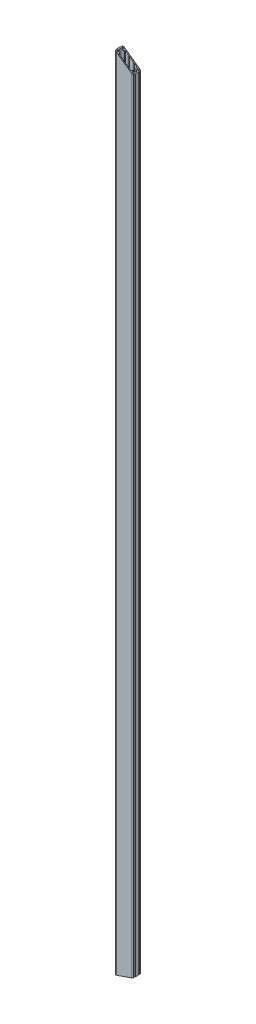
ISO-10303-21;
HEADER;
FILE_DESCRIPTION(('STEP AP214'),'2;1');
FILE_NAME('part.step','',(''),(''),'','','');
FILE_SCHEMA(('AUTOMOTIVE_DESIGN { 1 0 10303 214 1 1 1 1 }'));
ENDSEC;
DATA;
#1=APPLICATION_CONTEXT('core data for automotive mechanical design processes');
#2=APPLICATION_PROTOCOL_DEFINITION('international standard','automotive_design',2000,#1);
#3=PRODUCT_CONTEXT('',#1,'mechanical');
#4=PRODUCT('Part','Part','',(#3));
#5=PRODUCT_RELATED_PRODUCT_CATEGORY('part','',(#4));
#6=PRODUCT_DEFINITION_FORMATION('','',#4);
#7=PRODUCT_DEFINITION_CONTEXT('part definition',#1,'design');
#8=PRODUCT_DEFINITION('design','',#6,#7);
#9=PRODUCT_DEFINITION_SHAPE('','',#8);
#10=(LENGTH_UNIT() NAMED_UNIT(*) SI_UNIT(.MILLI.,.METRE.));
#11=(NAMED_UNIT(*) PLANE_ANGLE_UNIT() SI_UNIT($,.RADIAN.));
#12=(NAMED_UNIT(*) SI_UNIT($,.STERADIAN.) SOLID_ANGLE_UNIT());
#13=UNCERTAINTY_MEASURE_WITH_UNIT(LENGTH_MEASURE(1.E-05),#10,'distance_accuracy_value','');
#14=(GEOMETRIC_REPRESENTATION_CONTEXT(3) GLOBAL_UNCERTAINTY_ASSIGNED_CONTEXT((#13)) GLOBAL_UNIT_ASSIGNED_CONTEXT((#10,
#11,#12)) REPRESENTATION_CONTEXT('',''));
#15=CARTESIAN_POINT('',(0.,0.,0.));
#16=DIRECTION('',(0.,0.,1.));
#17=DIRECTION('',(1.,0.,0.));
#18=AXIS2_PLACEMENT_3D('',#15,#16,#17);
#19=CARTESIAN_POINT('',(84.6938611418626,7940.,-30.5717765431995));
#20=DIRECTION('',(0.,-1.,0.));
#21=DIRECTION('',(0.,0.,-1.));
#22=AXIS2_PLACEMENT_3D('',#19,#20,#21);
#23=CYLINDRICAL_SURFACE('',#22,3.99999999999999);
#24=DIRECTION('',(0.,-1.,0.));
#25=VECTOR('',#24,1.);
#26=CARTESIAN_POINT('',(81.1914378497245,7940.,-28.6396711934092));
#27=LINE('',#26,#25);
#28=CARTESIAN_POINT('',(81.1914378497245,7818.16061444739,-28.6396711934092));
#29=VERTEX_POINT('',#28);
#30=CARTESIAN_POINT('',(81.1914378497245,59.3472810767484,-28.6396711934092));
#31=VERTEX_POINT('',#30);
#32=EDGE_CURVE('E602',#29,#31,#27,.T.);
#33=ORIENTED_EDGE('',*,*,#32,.T.);
#34=CARTESIAN_POINT('',(84.6938611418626,60.5614732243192,-30.5717765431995));
#35=DIRECTION('',(-0.327547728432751,0.9448346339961,0.));
#36=DIRECTION('',(-0.9448346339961,-0.327547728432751,0.));
#37=AXIS2_PLACEMENT_3D('',#34,#35,#36);
#38=ELLIPSE('',#37,4.23354506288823,3.99999999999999);
#39=CARTESIAN_POINT('',(88.1962844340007,61.7756653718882,-32.5038818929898));
#40=VERTEX_POINT('',#39);
#41=EDGE_CURVE('E54',#31,#40,#38,.T.);
#42=ORIENTED_EDGE('',*,*,#41,.T.);
#43=DIRECTION('',(0.,-1.,0.));
#44=VECTOR('',#43,1.);
#45=CARTESIAN_POINT('',(88.1962844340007,7940.,-32.5038818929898));
#46=LINE('',#45,#44);
#47=CARTESIAN_POINT('',(88.1962844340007,7813.17516532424,-32.5038818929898));
#48=VERTEX_POINT('',#47);
#49=EDGE_CURVE('E443',#48,#40,#46,.T.);
#50=ORIENTED_EDGE('',*,*,#49,.F.);
#51=CARTESIAN_POINT('',(84.6938611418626,7815.66788988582,-30.5717765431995));
#52=DIRECTION('',(-0.579850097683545,-0.814723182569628,0.));
#53=DIRECTION('',(0.814723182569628,-0.579850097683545,0.));
#54=AXIS2_PLACEMENT_3D('',#51,#52,#53);
#55=ELLIPSE('',#54,4.90964303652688,3.99999999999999);
#56=EDGE_CURVE('E781',#48,#29,#55,.T.);
#57=ORIENTED_EDGE('',*,*,#56,.T.);
#58=EDGE_LOOP('',(#33,#42,#50,#57));
#59=FACE_BOUND('',#58,.T.);
#60=ADVANCED_FACE('F39',(#59),#23,.T.);
#61=CARTESIAN_POINT('',(75.5,7940.,-25.5));
#62=DIRECTION('',(0.,-1.,0.));
#63=DIRECTION('',(0.,0.,-1.));
#64=AXIS2_PLACEMENT_3D('',#61,#62,#63);
#65=CYLINDRICAL_SURFACE('',#64,14.5);
#66=ORIENTED_EDGE('',*,*,#49,.T.);
#67=CARTESIAN_POINT('',(75.5,57.3742188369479,-25.5));
#68=DIRECTION('',(-0.327547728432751,0.9448346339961,0.));
#69=DIRECTION('',(-0.9448346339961,-0.327547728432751,0.));
#70=AXIS2_PLACEMENT_3D('',#67,#68,#69);
#71=ELLIPSE('',#70,15.3466008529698,14.5);
#72=CARTESIAN_POINT('',(75.4999999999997,57.3742188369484,-40.));
#73=VERTEX_POINT('',#72);
#74=EDGE_CURVE('E944',#40,#73,#71,.T.);
#75=ORIENTED_EDGE('',*,*,#74,.T.);
#76=DIRECTION('',(0.,-1.,0.));
#77=VECTOR('',#76,1.);
#78=CARTESIAN_POINT('',(75.5,7940.,-40.));
#79=LINE('',#78,#77);
#80=CARTESIAN_POINT('',(75.4999999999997,7822.21129185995,-40.));
#81=VERTEX_POINT('',#80);
#82=EDGE_CURVE('E439',#81,#73,#79,.T.);
#83=ORIENTED_EDGE('',*,*,#82,.F.);
#84=CARTESIAN_POINT('',(75.5,7822.21129185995,-25.5));
#85=DIRECTION('',(-0.579850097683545,-0.814723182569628,0.));
#86=DIRECTION('',(0.814723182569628,-0.579850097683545,0.));
#87=AXIS2_PLACEMENT_3D('',#84,#85,#86);
#88=ELLIPSE('',#87,17.79745600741,14.5);
#89=EDGE_CURVE('E785',#81,#48,#88,.T.);
#90=ORIENTED_EDGE('',*,*,#89,.T.);
#91=EDGE_LOOP('',(#66,#75,#83,#90));
#92=FACE_BOUND('',#91,.T.);
#93=ADVANCED_FACE('F964',(#92),#65,.T.);
#94=CARTESIAN_POINT('',(75.5,7940.,-40.));
#95=DIRECTION('',(0.,0.,1.));
#96=DIRECTION('',(1.,0.,0.));
#97=AXIS2_PLACEMENT_3D('',#94,#95,#96);
#98=PLANE('',#97);
#99=ORIENTED_EDGE('',*,*,#82,.T.);
#100=DIRECTION('',(-0.9448346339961,-0.327547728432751,0.));
#101=VECTOR('',#100,1.);
#102=CARTESIAN_POINT('',(90.,62.4009630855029,-40.));
#103=LINE('',#102,#101);
#104=CARTESIAN_POINT('',(-75.5,5.02674424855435,-40.));
#105=VERTEX_POINT('',#104);
#106=EDGE_CURVE('E388',#73,#105,#103,.T.);
#107=ORIENTED_EDGE('',*,*,#106,.T.);
#108=DIRECTION('',(0.,-1.,0.));
#109=VECTOR('',#108,1.);
#110=CARTESIAN_POINT('',(-75.5,7940.,-40.));
#111=LINE('',#110,#109);
#112=CARTESIAN_POINT('',(-75.5,7929.68014339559,-40.));
#113=VERTEX_POINT('',#112);
#114=EDGE_CURVE('E435',#113,#105,#111,.T.);
#115=ORIENTED_EDGE('',*,*,#114,.F.);
#116=DIRECTION('',(0.814723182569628,-0.579850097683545,0.));
#117=VECTOR('',#116,1.);
#118=CARTESIAN_POINT('',(90.,7811.89143525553,-40.));
#119=LINE('',#118,#117);
#120=EDGE_CURVE('E676',#113,#81,#119,.T.);
#121=ORIENTED_EDGE('',*,*,#120,.T.);
#122=EDGE_LOOP('',(#99,#107,#115,#121));
#123=FACE_BOUND('',#122,.T.);
#124=ADVANCED_FACE('F834',(#123),#98,.F.);
#125=CARTESIAN_POINT('',(-75.5,7940.,-25.5));
#126=DIRECTION('',(0.,-1.,0.));
#127=DIRECTION('',(0.,0.,-1.));
#128=AXIS2_PLACEMENT_3D('',#125,#126,#127);
#129=CYLINDRICAL_SURFACE('',#128,14.5);
#130=ORIENTED_EDGE('',*,*,#114,.T.);
#131=CARTESIAN_POINT('',(-75.5,5.02674424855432,-25.5));
#132=DIRECTION('',(-0.327547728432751,0.9448346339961,0.));
#133=DIRECTION('',(-0.9448346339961,-0.327547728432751,0.));
#134=AXIS2_PLACEMENT_3D('',#131,#132,#133);
#135=ELLIPSE('',#134,15.3466008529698,14.5);
#136=CARTESIAN_POINT('',(-88.1962844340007,0.62529771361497,-32.5038818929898));
#137=VERTEX_POINT('',#136);
#138=EDGE_CURVE('E671',#105,#137,#135,.T.);
#139=ORIENTED_EDGE('',*,*,#138,.T.);
#140=DIRECTION('',(0.,-1.,0.));
#141=VECTOR('',#140,1.);
#142=CARTESIAN_POINT('',(-88.1962844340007,7940.,-32.5038818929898));
#143=LINE('',#142,#141);
#144=CARTESIAN_POINT('',(-88.1962844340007,7938.71626993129,-32.5038818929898));
#145=VERTEX_POINT('',#144);
#146=EDGE_CURVE('E431',#145,#137,#143,.T.);
#147=ORIENTED_EDGE('',*,*,#146,.F.);
#148=CARTESIAN_POINT('',(-75.5,7929.68014339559,-25.5));
#149=DIRECTION('',(-0.579850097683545,-0.814723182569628,0.));
#150=DIRECTION('',(0.814723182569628,-0.579850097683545,0.));
#151=AXIS2_PLACEMENT_3D('',#148,#149,#150);
#152=ELLIPSE('',#151,17.79745600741,14.5);
#153=EDGE_CURVE('E479',#145,#113,#152,.T.);
#154=ORIENTED_EDGE('',*,*,#153,.T.);
#155=EDGE_LOOP('',(#130,#139,#147,#154));
#156=FACE_BOUND('',#155,.T.);
#157=ADVANCED_FACE('F831',(#156),#129,.T.);
#158=CARTESIAN_POINT('',(-84.6938611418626,7940.,-30.5717765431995));
#159=DIRECTION('',(0.,-1.,0.));
#160=DIRECTION('',(0.,0.,-1.));
#161=AXIS2_PLACEMENT_3D('',#158,#159,#160);
#162=CYLINDRICAL_SURFACE('',#161,3.99999999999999);
#163=ORIENTED_EDGE('',*,*,#146,.T.);
#164=CARTESIAN_POINT('',(-84.6938611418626,1.83948986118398,-30.5717765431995));
#165=DIRECTION('',(-0.327547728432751,0.9448346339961,0.));
#166=DIRECTION('',(-0.9448346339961,-0.327547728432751,0.));
#167=AXIS2_PLACEMENT_3D('',#164,#165,#166);
#168=ELLIPSE('',#167,4.23354506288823,3.99999999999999);
#169=CARTESIAN_POINT('',(-81.1914378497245,3.05368200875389,-28.6396711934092));
#170=VERTEX_POINT('',#169);
#171=EDGE_CURVE('E667',#137,#170,#168,.T.);
#172=ORIENTED_EDGE('',*,*,#171,.T.);
#173=DIRECTION('',(0.,-1.,0.));
#174=VECTOR('',#173,1.);
#175=CARTESIAN_POINT('',(-81.1914378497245,7940.,-28.6396711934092));
#176=LINE('',#175,#174);
#177=CARTESIAN_POINT('',(-81.1914378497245,7933.73082080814,-28.6396711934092));
#178=VERTEX_POINT('',#177);
#179=EDGE_CURVE('E427',#178,#170,#176,.T.);
#180=ORIENTED_EDGE('',*,*,#179,.F.);
#181=CARTESIAN_POINT('',(-84.6938611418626,7936.22354536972,-30.5717765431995));
#182=DIRECTION('',(-0.579850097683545,-0.814723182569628,0.));
#183=DIRECTION('',(0.814723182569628,-0.579850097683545,0.));
#184=AXIS2_PLACEMENT_3D('',#181,#182,#183);
#185=ELLIPSE('',#184,4.90964303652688,3.99999999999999);
#186=EDGE_CURVE('E823',#178,#145,#185,.T.);
#187=ORIENTED_EDGE('',*,*,#186,.T.);
#188=EDGE_LOOP('',(#163,#172,#180,#187));
#189=FACE_BOUND('',#188,.T.);
#190=ADVANCED_FACE('F974',(#189),#162,.T.);
#191=CARTESIAN_POINT('',(-75.5,7940.,-25.5));
#192=DIRECTION('',(0.,-1.,0.));
#193=DIRECTION('',(0.,0.,-1.));
#194=AXIS2_PLACEMENT_3D('',#191,#192,#193);
#195=CYLINDRICAL_SURFACE('',#194,6.5);
#196=ORIENTED_EDGE('',*,*,#179,.T.);
#197=CARTESIAN_POINT('',(-75.5,5.02674424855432,-25.5));
#198=DIRECTION('',(-0.327547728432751,0.9448346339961,0.));
#199=DIRECTION('',(-0.9448346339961,-0.327547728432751,0.));
#200=AXIS2_PLACEMENT_3D('',#197,#198,#199);
#201=ELLIPSE('',#200,6.87951072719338,6.5);
#202=CARTESIAN_POINT('',(-79.7220192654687,3.56308831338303,-20.5578796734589));
#203=VERTEX_POINT('',#202);
#204=EDGE_CURVE('E663',#170,#203,#201,.F.);
#205=ORIENTED_EDGE('',*,*,#204,.T.);
#206=DIRECTION('',(0.,-1.,0.));
#207=VECTOR('',#206,1.);
#208=CARTESIAN_POINT('',(-79.7220192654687,7940.,-20.5578796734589));
#209=LINE('',#208,#207);
#210=CARTESIAN_POINT('',(-79.7220192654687,7932.6850146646,-20.5578796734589));
#211=VERTEX_POINT('',#210);
#212=EDGE_CURVE('E423',#211,#203,#209,.T.);
#213=ORIENTED_EDGE('',*,*,#212,.F.);
#214=CARTESIAN_POINT('',(-75.5,7929.68014339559,-25.5));
#215=DIRECTION('',(-0.579850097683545,-0.814723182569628,0.));
#216=DIRECTION('',(0.814723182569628,-0.579850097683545,0.));
#217=AXIS2_PLACEMENT_3D('',#214,#215,#216);
#218=ELLIPSE('',#217,7.9781699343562,6.5);
#219=EDGE_CURVE('E819',#211,#178,#218,.F.);
#220=ORIENTED_EDGE('',*,*,#219,.T.);
#221=EDGE_LOOP('',(#196,#205,#213,#220));
#222=FACE_BOUND('',#221,.T.);
#223=ADVANCED_FACE('F977',(#222),#195,.F.);
#224=CARTESIAN_POINT('',(-83.7691890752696,7940.,-15.8204308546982));
#225=DIRECTION('',(0.,-1.,0.));
#226=DIRECTION('',(0.,0.,-1.));
#227=AXIS2_PLACEMENT_3D('',#224,#225,#226);
#228=CYLINDRICAL_SURFACE('',#227,6.23081092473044);
#229=ORIENTED_EDGE('',*,*,#212,.T.);
#230=CARTESIAN_POINT('',(-83.7691890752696,2.16004779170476,-15.8204308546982));
#231=DIRECTION('',(-0.327547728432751,0.9448346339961,0.));
#232=DIRECTION('',(-0.9448346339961,-0.327547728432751,0.));
#233=AXIS2_PLACEMENT_3D('',#230,#231,#232);
#234=ELLIPSE('',#233,6.59460470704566,6.23081092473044);
#235=CARTESIAN_POINT('',(-90.,0.,-15.8204308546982));
#236=VERTEX_POINT('',#235);
#237=EDGE_CURVE('E659',#203,#236,#234,.T.);
#238=ORIENTED_EDGE('',*,*,#237,.T.);
#239=DIRECTION('',(0.,-1.,0.));
#240=VECTOR('',#239,1.);
#241=CARTESIAN_POINT('',(-90.,7940.,-15.8204308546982));
#242=LINE('',#241,#240);
#243=CARTESIAN_POINT('',(-90.,7940.,-15.8204308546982));
#244=VERTEX_POINT('',#243);
#245=EDGE_CURVE('E419',#244,#236,#242,.T.);
#246=ORIENTED_EDGE('',*,*,#245,.F.);
#247=CARTESIAN_POINT('',(-83.7691890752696,7935.56544308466,-15.8204308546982));
#248=DIRECTION('',(-0.579850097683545,-0.814723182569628,0.));
#249=DIRECTION('',(0.814723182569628,-0.579850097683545,0.));
#250=AXIS2_PLACEMENT_3D('',#247,#248,#249);
#251=ELLIPSE('',#250,7.64776436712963,6.23081092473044);
#252=EDGE_CURVE('E815',#244,#211,#251,.T.);
#253=ORIENTED_EDGE('',*,*,#252,.T.);
#254=EDGE_LOOP('',(#229,#238,#246,#253));
#255=FACE_BOUND('',#254,.T.);
#256=ADVANCED_FACE('F981',(#255),#228,.T.);
#257=CARTESIAN_POINT('',(-90.,7940.,15.8204308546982));
#258=DIRECTION('',(1.,0.,0.));
#259=DIRECTION('',(0.,0.,-1.));
#260=AXIS2_PLACEMENT_3D('',#257,#258,#259);
#261=PLANE('',#260);
#262=DIRECTION('',(0.,0.,1.));
#263=VECTOR('',#262,1.);
#264=CARTESIAN_POINT('',(-90.,0.,15.8204308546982));
#265=LINE('',#264,#263);
#266=CARTESIAN_POINT('',(-90.,0.,15.8204308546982));
#267=VERTEX_POINT('',#266);
#268=EDGE_CURVE('E598',#236,#267,#265,.T.);
#269=ORIENTED_EDGE('',*,*,#268,.T.);
#270=DIRECTION('',(0.,-1.,0.));
#271=VECTOR('',#270,1.);
#272=CARTESIAN_POINT('',(-90.,7940.,15.8204308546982));
#273=LINE('',#272,#271);
#274=CARTESIAN_POINT('',(-90.,7940.,15.8204308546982));
#275=VERTEX_POINT('',#274);
#276=EDGE_CURVE('E415',#275,#267,#273,.T.);
#277=ORIENTED_EDGE('',*,*,#276,.F.);
#278=DIRECTION('',(0.,0.,1.));
#279=VECTOR('',#278,1.);
#280=CARTESIAN_POINT('',(-90.,7940.,15.8204308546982));
#281=LINE('',#280,#279);
#282=EDGE_CURVE('E599',#244,#275,#281,.T.);
#283=ORIENTED_EDGE('',*,*,#282,.F.);
#284=ORIENTED_EDGE('',*,*,#245,.T.);
#285=EDGE_LOOP('',(#269,#277,#283,#284));
#286=FACE_BOUND('',#285,.T.);
#287=ADVANCED_FACE('F985',(#286),#261,.F.);
#288=CARTESIAN_POINT('',(-83.7691890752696,7940.,15.8204308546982));
#289=DIRECTION('',(0.,-1.,0.));
#290=DIRECTION('',(0.,0.,-1.));
#291=AXIS2_PLACEMENT_3D('',#288,#289,#290);
#292=CYLINDRICAL_SURFACE('',#291,6.23081092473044);
#293=ORIENTED_EDGE('',*,*,#276,.T.);
#294=CARTESIAN_POINT('',(-83.7691890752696,2.16004779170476,15.8204308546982));
#295=DIRECTION('',(-0.327547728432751,0.9448346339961,0.));
#296=DIRECTION('',(-0.9448346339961,-0.327547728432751,0.));
#297=AXIS2_PLACEMENT_3D('',#294,#295,#296);
#298=ELLIPSE('',#297,6.59460470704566,6.23081092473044);
#299=CARTESIAN_POINT('',(-79.7220192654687,3.56308831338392,20.5578796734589));
#300=VERTEX_POINT('',#299);
#301=EDGE_CURVE('E655',#267,#300,#298,.T.);
#302=ORIENTED_EDGE('',*,*,#301,.T.);
#303=DIRECTION('',(0.,-1.,0.));
#304=VECTOR('',#303,1.);
#305=CARTESIAN_POINT('',(-79.7220192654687,7940.,20.5578796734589));
#306=LINE('',#305,#304);
#307=CARTESIAN_POINT('',(-79.7220192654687,7932.6850146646,20.5578796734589));
#308=VERTEX_POINT('',#307);
#309=EDGE_CURVE('E411',#308,#300,#306,.T.);
#310=ORIENTED_EDGE('',*,*,#309,.F.);
#311=CARTESIAN_POINT('',(-83.7691890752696,7935.56544308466,15.8204308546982));
#312=DIRECTION('',(-0.579850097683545,-0.814723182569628,0.));
#313=DIRECTION('',(0.814723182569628,-0.579850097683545,0.));
#314=AXIS2_PLACEMENT_3D('',#311,#312,#313);
#315=ELLIPSE('',#314,7.64776436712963,6.23081092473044);
#316=EDGE_CURVE('E811',#308,#275,#315,.T.);
#317=ORIENTED_EDGE('',*,*,#316,.T.);
#318=EDGE_LOOP('',(#293,#302,#310,#317));
#319=FACE_BOUND('',#318,.T.);
#320=ADVANCED_FACE('F989',(#319),#292,.T.);
#321=CARTESIAN_POINT('',(-75.5,7940.,25.5));
#322=DIRECTION('',(0.,-1.,0.));
#323=DIRECTION('',(0.,0.,-1.));
#324=AXIS2_PLACEMENT_3D('',#321,#322,#323);
#325=CYLINDRICAL_SURFACE('',#324,6.5);
#326=ORIENTED_EDGE('',*,*,#309,.T.);
#327=CARTESIAN_POINT('',(-75.5,5.02674424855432,25.5));
#328=DIRECTION('',(-0.327547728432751,0.9448346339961,0.));
#329=DIRECTION('',(-0.9448346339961,-0.327547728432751,0.));
#330=AXIS2_PLACEMENT_3D('',#327,#328,#329);
#331=ELLIPSE('',#330,6.87951072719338,6.5);
#332=CARTESIAN_POINT('',(-81.1914378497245,3.053682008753,28.6396711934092));
#333=VERTEX_POINT('',#332);
#334=EDGE_CURVE('E651',#300,#333,#331,.F.);
#335=ORIENTED_EDGE('',*,*,#334,.T.);
#336=DIRECTION('',(0.,-1.,0.));
#337=VECTOR('',#336,1.);
#338=CARTESIAN_POINT('',(-81.1914378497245,7940.,28.6396711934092));
#339=LINE('',#338,#337);
#340=CARTESIAN_POINT('',(-81.1914378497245,7933.73082080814,28.6396711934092));
#341=VERTEX_POINT('',#340);
#342=EDGE_CURVE('E407',#341,#333,#339,.T.);
#343=ORIENTED_EDGE('',*,*,#342,.F.);
#344=CARTESIAN_POINT('',(-75.5,7929.68014339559,25.5));
#345=DIRECTION('',(-0.579850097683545,-0.814723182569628,0.));
#346=DIRECTION('',(0.814723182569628,-0.579850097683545,0.));
#347=AXIS2_PLACEMENT_3D('',#344,#345,#346);
#348=ELLIPSE('',#347,7.9781699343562,6.5);
#349=EDGE_CURVE('E807',#341,#308,#348,.F.);
#350=ORIENTED_EDGE('',*,*,#349,.T.);
#351=EDGE_LOOP('',(#326,#335,#343,#350));
#352=FACE_BOUND('',#351,.T.);
#353=ADVANCED_FACE('F993',(#352),#325,.F.);
#354=CARTESIAN_POINT('',(-84.6938611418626,7940.,30.5717765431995));
#355=DIRECTION('',(0.,-1.,0.));
#356=DIRECTION('',(0.,0.,-1.));
#357=AXIS2_PLACEMENT_3D('',#354,#355,#356);
#358=CYLINDRICAL_SURFACE('',#357,3.99999999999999);
#359=ORIENTED_EDGE('',*,*,#342,.T.);
#360=CARTESIAN_POINT('',(-84.6938611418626,1.83948986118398,30.5717765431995));
#361=DIRECTION('',(-0.327547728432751,0.9448346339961,0.));
#362=DIRECTION('',(-0.9448346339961,-0.327547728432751,0.));
#363=AXIS2_PLACEMENT_3D('',#360,#361,#362);
#364=ELLIPSE('',#363,4.23354506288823,3.99999999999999);
#365=CARTESIAN_POINT('',(-88.1962844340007,0.62529771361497,32.5038818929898));
#366=VERTEX_POINT('',#365);
#367=EDGE_CURVE('E647',#333,#366,#364,.T.);
#368=ORIENTED_EDGE('',*,*,#367,.T.);
#369=DIRECTION('',(0.,-1.,0.));
#370=VECTOR('',#369,1.);
#371=CARTESIAN_POINT('',(-88.1962844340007,7940.,32.5038818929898));
#372=LINE('',#371,#370);
#373=CARTESIAN_POINT('',(-88.1962844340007,7938.71626993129,32.5038818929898));
#374=VERTEX_POINT('',#373);
#375=EDGE_CURVE('E398',#374,#366,#372,.T.);
#376=ORIENTED_EDGE('',*,*,#375,.F.);
#377=CARTESIAN_POINT('',(-84.6938611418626,7936.22354536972,30.5717765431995));
#378=DIRECTION('',(-0.579850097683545,-0.814723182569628,0.));
#379=DIRECTION('',(0.814723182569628,-0.579850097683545,0.));
#380=AXIS2_PLACEMENT_3D('',#377,#378,#379);
#381=ELLIPSE('',#380,4.90964303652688,3.99999999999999);
#382=EDGE_CURVE('E803',#374,#341,#381,.T.);
#383=ORIENTED_EDGE('',*,*,#382,.T.);
#384=EDGE_LOOP('',(#359,#368,#376,#383));
#385=FACE_BOUND('',#384,.T.);
#386=ADVANCED_FACE('F997',(#385),#358,.T.);
#387=CARTESIAN_POINT('',(-75.5,7940.,25.5));
#388=DIRECTION('',(0.,-1.,0.));
#389=DIRECTION('',(0.,0.,-1.));
#390=AXIS2_PLACEMENT_3D('',#387,#388,#389);
#391=CYLINDRICAL_SURFACE('',#390,14.5);
#392=ORIENTED_EDGE('',*,*,#375,.T.);
#393=CARTESIAN_POINT('',(-75.5,5.02674424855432,25.5));
#394=DIRECTION('',(-0.327547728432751,0.9448346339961,0.));
#395=DIRECTION('',(-0.9448346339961,-0.327547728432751,0.));
#396=AXIS2_PLACEMENT_3D('',#393,#394,#395);
#397=ELLIPSE('',#396,15.3466008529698,14.5);
#398=CARTESIAN_POINT('',(-75.5,5.02674424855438,40.));
#399=VERTEX_POINT('',#398);
#400=EDGE_CURVE('E377',#366,#399,#397,.T.);
#401=ORIENTED_EDGE('',*,*,#400,.T.);
#402=DIRECTION('',(0.,-1.,0.));
#403=VECTOR('',#402,1.);
#404=CARTESIAN_POINT('',(-75.5,7940.,40.));
#405=LINE('',#404,#403);
#406=CARTESIAN_POINT('',(-75.5000000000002,7929.68014339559,40.));
#407=VERTEX_POINT('',#406);
#408=EDGE_CURVE('E386',#407,#399,#405,.T.);
#409=ORIENTED_EDGE('',*,*,#408,.F.);
#410=CARTESIAN_POINT('',(-75.5,7929.68014339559,25.5));
#411=DIRECTION('',(-0.579850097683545,-0.814723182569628,0.));
#412=DIRECTION('',(0.814723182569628,-0.579850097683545,0.));
#413=AXIS2_PLACEMENT_3D('',#410,#411,#412);
#414=ELLIPSE('',#413,17.79745600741,14.5);
#415=EDGE_CURVE('E799',#407,#374,#414,.T.);
#416=ORIENTED_EDGE('',*,*,#415,.T.);
#417=EDGE_LOOP('',(#392,#401,#409,#416));
#418=FACE_BOUND('',#417,.T.);
#419=ADVANCED_FACE('F1001',(#418),#391,.T.);
#420=CARTESIAN_POINT('',(75.5,7940.,40.));
#421=DIRECTION('',(0.,0.,-1.));
#422=DIRECTION('',(-1.,0.,0.));
#423=AXIS2_PLACEMENT_3D('',#420,#421,#422);
#424=PLANE('',#423);
#425=ORIENTED_EDGE('',*,*,#408,.T.);
#426=DIRECTION('',(-0.9448346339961,-0.327547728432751,0.));
#427=VECTOR('',#426,1.);
#428=CARTESIAN_POINT('',(90.,62.4009630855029,40.));
#429=LINE('',#428,#427);
#430=CARTESIAN_POINT('',(75.5,57.3742188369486,40.));
#431=VERTEX_POINT('',#430);
#432=EDGE_CURVE('E368',#431,#399,#429,.T.);
#433=ORIENTED_EDGE('',*,*,#432,.F.);
#434=DIRECTION('',(0.,-1.,0.));
#435=VECTOR('',#434,1.);
#436=CARTESIAN_POINT('',(75.5,7940.,40.));
#437=LINE('',#436,#435);
#438=CARTESIAN_POINT('',(75.5,7822.21129185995,40.));
#439=VERTEX_POINT('',#438);
#440=EDGE_CURVE('E384',#439,#431,#437,.T.);
#441=ORIENTED_EDGE('',*,*,#440,.F.);
#442=DIRECTION('',(0.814723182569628,-0.579850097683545,0.));
#443=VECTOR('',#442,1.);
#444=CARTESIAN_POINT('',(90.,7811.89143525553,40.));
#445=LINE('',#444,#443);
#446=EDGE_CURVE('E675',#407,#439,#445,.T.);
#447=ORIENTED_EDGE('',*,*,#446,.F.);
#448=EDGE_LOOP('',(#425,#433,#441,#447));
#449=FACE_BOUND('',#448,.T.);
#450=ADVANCED_FACE('F382',(#449),#424,.F.);
#451=CARTESIAN_POINT('',(75.5,7940.,25.5));
#452=DIRECTION('',(0.,-1.,0.));
#453=DIRECTION('',(0.,0.,-1.));
#454=AXIS2_PLACEMENT_3D('',#451,#452,#453);
#455=CYLINDRICAL_SURFACE('',#454,14.5);
#456=ORIENTED_EDGE('',*,*,#440,.T.);
#457=CARTESIAN_POINT('',(75.5,57.3742188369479,25.5));
#458=DIRECTION('',(-0.327547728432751,0.9448346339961,0.));
#459=DIRECTION('',(-0.9448346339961,-0.327547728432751,0.));
#460=AXIS2_PLACEMENT_3D('',#457,#458,#459);
#461=ELLIPSE('',#460,15.3466008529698,14.5);
#462=CARTESIAN_POINT('',(88.1962844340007,61.7756653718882,32.5038818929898));
#463=VERTEX_POINT('',#462);
#464=EDGE_CURVE('E365',#431,#463,#461,.T.);
#465=ORIENTED_EDGE('',*,*,#464,.T.);
#466=DIRECTION('',(0.,-1.,0.));
#467=VECTOR('',#466,1.);
#468=CARTESIAN_POINT('',(88.1962844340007,7940.,32.5038818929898));
#469=LINE('',#468,#467);
#470=CARTESIAN_POINT('',(88.1962844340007,7813.17516532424,32.5038818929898));
#471=VERTEX_POINT('',#470);
#472=EDGE_CURVE('E394',#471,#463,#469,.T.);
#473=ORIENTED_EDGE('',*,*,#472,.F.);
#474=CARTESIAN_POINT('',(75.5,7822.21129185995,25.5));
#475=DIRECTION('',(-0.579850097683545,-0.814723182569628,0.));
#476=DIRECTION('',(0.814723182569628,-0.579850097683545,0.));
#477=AXIS2_PLACEMENT_3D('',#474,#475,#476);
#478=ELLIPSE('',#477,17.79745600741,14.5);
#479=EDGE_CURVE('E392',#471,#439,#478,.T.);
#480=ORIENTED_EDGE('',*,*,#479,.T.);
#481=EDGE_LOOP('',(#456,#465,#473,#480));
#482=FACE_BOUND('',#481,.T.);
#483=ADVANCED_FACE('F391',(#482),#455,.T.);
#484=CARTESIAN_POINT('',(84.6938611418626,7940.,30.5717765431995));
#485=DIRECTION('',(0.,-1.,0.));
#486=DIRECTION('',(0.,0.,-1.));
#487=AXIS2_PLACEMENT_3D('',#484,#485,#486);
#488=CYLINDRICAL_SURFACE('',#487,3.99999999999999);
#489=ORIENTED_EDGE('',*,*,#472,.T.);
#490=CARTESIAN_POINT('',(84.6938611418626,60.5614732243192,30.5717765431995));
#491=DIRECTION('',(-0.327547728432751,0.9448346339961,0.));
#492=DIRECTION('',(-0.9448346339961,-0.327547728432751,0.));
#493=AXIS2_PLACEMENT_3D('',#490,#491,#492);
#494=ELLIPSE('',#493,4.23354506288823,3.99999999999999);
#495=CARTESIAN_POINT('',(81.1914378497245,59.3472810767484,28.6396711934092));
#496=VERTEX_POINT('',#495);
#497=EDGE_CURVE('E371',#463,#496,#494,.T.);
#498=ORIENTED_EDGE('',*,*,#497,.T.);
#499=DIRECTION('',(0.,-1.,0.));
#500=VECTOR('',#499,1.);
#501=CARTESIAN_POINT('',(81.1914378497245,7940.,28.6396711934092));
#502=LINE('',#501,#500);
#503=CARTESIAN_POINT('',(81.1914378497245,7818.16061444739,28.6396711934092));
#504=VERTEX_POINT('',#503);
#505=EDGE_CURVE('E400',#504,#496,#502,.T.);
#506=ORIENTED_EDGE('',*,*,#505,.F.);
#507=CARTESIAN_POINT('',(84.6938611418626,7815.66788988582,30.5717765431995));
#508=DIRECTION('',(-0.579850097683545,-0.814723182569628,0.));
#509=DIRECTION('',(0.814723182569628,-0.579850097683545,0.));
#510=AXIS2_PLACEMENT_3D('',#507,#508,#509);
#511=ELLIPSE('',#510,4.90964303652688,3.99999999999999);
#512=EDGE_CURVE('E637',#504,#471,#511,.T.);
#513=ORIENTED_EDGE('',*,*,#512,.T.);
#514=EDGE_LOOP('',(#489,#498,#506,#513));
#515=FACE_BOUND('',#514,.T.);
#516=ADVANCED_FACE('F636',(#515),#488,.T.);
#517=CARTESIAN_POINT('',(75.5,7940.,25.5));
#518=DIRECTION('',(0.,-1.,0.));
#519=DIRECTION('',(0.,0.,-1.));
#520=AXIS2_PLACEMENT_3D('',#517,#518,#519);
#521=CYLINDRICAL_SURFACE('',#520,6.5);
#522=ORIENTED_EDGE('',*,*,#505,.T.);
#523=CARTESIAN_POINT('',(75.5,57.3742188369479,25.5));
#524=DIRECTION('',(-0.327547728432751,0.9448346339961,0.));
#525=DIRECTION('',(-0.9448346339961,-0.327547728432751,0.));
#526=AXIS2_PLACEMENT_3D('',#523,#524,#525);
#527=ELLIPSE('',#526,6.87951072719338,6.5);
#528=CARTESIAN_POINT('',(79.7220192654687,58.8378747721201,20.5578796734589));
#529=VERTEX_POINT('',#528);
#530=EDGE_CURVE('E632',#496,#529,#527,.F.);
#531=ORIENTED_EDGE('',*,*,#530,.T.);
#532=DIRECTION('',(0.,-1.,0.));
#533=VECTOR('',#532,1.);
#534=CARTESIAN_POINT('',(79.7220192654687,7940.,20.5578796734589));
#535=LINE('',#534,#533);
#536=CARTESIAN_POINT('',(79.7220192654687,7819.20642059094,20.5578796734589));
#537=VERTEX_POINT('',#536);
#538=EDGE_CURVE('E621',#537,#529,#535,.T.);
#539=ORIENTED_EDGE('',*,*,#538,.F.);
#540=CARTESIAN_POINT('',(75.5,7822.21129185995,25.5));
#541=DIRECTION('',(-0.579850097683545,-0.814723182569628,0.));
#542=DIRECTION('',(0.814723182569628,-0.579850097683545,0.));
#543=AXIS2_PLACEMENT_3D('',#540,#541,#542);
#544=ELLIPSE('',#543,7.9781699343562,6.5);
#545=EDGE_CURVE('E633',#537,#504,#544,.F.);
#546=ORIENTED_EDGE('',*,*,#545,.T.);
#547=EDGE_LOOP('',(#522,#531,#539,#546));
#548=FACE_BOUND('',#547,.T.);
#549=ADVANCED_FACE('F630',(#548),#521,.F.);
#550=CARTESIAN_POINT('',(83.7691890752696,7940.,15.8204308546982));
#551=DIRECTION('',(0.,-1.,0.));
#552=DIRECTION('',(0.,0.,-1.));
#553=AXIS2_PLACEMENT_3D('',#550,#551,#552);
#554=CYLINDRICAL_SURFACE('',#553,6.23081092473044);
#555=ORIENTED_EDGE('',*,*,#538,.T.);
#556=CARTESIAN_POINT('',(83.7691890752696,60.2409152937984,15.8204308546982));
#557=DIRECTION('',(-0.327547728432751,0.9448346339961,0.));
#558=DIRECTION('',(-0.9448346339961,-0.327547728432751,0.));
#559=AXIS2_PLACEMENT_3D('',#556,#557,#558);
#560=ELLIPSE('',#559,6.59460470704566,6.23081092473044);
#561=CARTESIAN_POINT('',(90.,62.4009630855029,15.8204308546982));
#562=VERTEX_POINT('',#561);
#563=EDGE_CURVE('E641',#529,#562,#560,.T.);
#564=ORIENTED_EDGE('',*,*,#563,.T.);
#565=DIRECTION('',(0.,-1.,0.));
#566=VECTOR('',#565,1.);
#567=CARTESIAN_POINT('',(90.,7940.,15.8204308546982));
#568=LINE('',#567,#566);
#569=CARTESIAN_POINT('',(90.,7811.89143525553,15.8204308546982));
#570=VERTEX_POINT('',#569);
#571=EDGE_CURVE('E617',#570,#562,#568,.T.);
#572=ORIENTED_EDGE('',*,*,#571,.F.);
#573=CARTESIAN_POINT('',(83.7691890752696,7816.32599217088,15.8204308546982));
#574=DIRECTION('',(-0.579850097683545,-0.814723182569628,0.));
#575=DIRECTION('',(0.814723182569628,-0.579850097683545,0.));
#576=AXIS2_PLACEMENT_3D('',#573,#574,#575);
#577=ELLIPSE('',#576,7.64776436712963,6.23081092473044);
#578=EDGE_CURVE('E789',#570,#537,#577,.T.);
#579=ORIENTED_EDGE('',*,*,#578,.T.);
#580=EDGE_LOOP('',(#555,#564,#572,#579));
#581=FACE_BOUND('',#580,.T.);
#582=ADVANCED_FACE('F950',(#581),#554,.T.);
#583=CARTESIAN_POINT('',(90.,7940.,15.8204308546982));
#584=DIRECTION('',(-1.,0.,0.));
#585=DIRECTION('',(0.,0.,1.));
#586=AXIS2_PLACEMENT_3D('',#583,#584,#585);
#587=PLANE('',#586);
#588=ORIENTED_EDGE('',*,*,#571,.T.);
#589=DIRECTION('',(0.,0.,1.));
#590=VECTOR('',#589,1.);
#591=CARTESIAN_POINT('',(90.,62.4009630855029,-40.));
#592=LINE('',#591,#590);
#593=CARTESIAN_POINT('',(90.,62.4009630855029,-15.8204308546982));
#594=VERTEX_POINT('',#593);
#595=EDGE_CURVE('E838',#594,#562,#592,.T.);
#596=ORIENTED_EDGE('',*,*,#595,.F.);
#597=DIRECTION('',(0.,-1.,0.));
#598=VECTOR('',#597,1.);
#599=CARTESIAN_POINT('',(90.,7940.,-15.8204308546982));
#600=LINE('',#599,#598);
#601=CARTESIAN_POINT('',(90.,7811.89143525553,-15.8204308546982));
#602=VERTEX_POINT('',#601);
#603=EDGE_CURVE('E613',#602,#594,#600,.T.);
#604=ORIENTED_EDGE('',*,*,#603,.F.);
#605=DIRECTION('',(0.,0.,1.));
#606=VECTOR('',#605,1.);
#607=CARTESIAN_POINT('',(90.,7811.89143525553,-40.));
#608=LINE('',#607,#606);
#609=EDGE_CURVE('E469',#602,#570,#608,.T.);
#610=ORIENTED_EDGE('',*,*,#609,.T.);
#611=EDGE_LOOP('',(#588,#596,#604,#610));
#612=FACE_BOUND('',#611,.T.);
#613=ADVANCED_FACE('F953',(#612),#587,.F.);
#614=CARTESIAN_POINT('',(83.7691890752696,7940.,-15.8204308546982));
#615=DIRECTION('',(0.,-1.,0.));
#616=DIRECTION('',(0.,0.,-1.));
#617=AXIS2_PLACEMENT_3D('',#614,#615,#616);
#618=CYLINDRICAL_SURFACE('',#617,6.23081092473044);
#619=ORIENTED_EDGE('',*,*,#603,.T.);
#620=CARTESIAN_POINT('',(83.7691890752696,60.2409152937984,-15.8204308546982));
#621=DIRECTION('',(-0.327547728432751,0.9448346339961,0.));
#622=DIRECTION('',(-0.9448346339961,-0.327547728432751,0.));
#623=AXIS2_PLACEMENT_3D('',#620,#621,#622);
#624=ELLIPSE('',#623,6.59460470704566,6.23081092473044);
#625=CARTESIAN_POINT('',(79.7220192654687,58.8378747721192,-20.5578796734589));
#626=VERTEX_POINT('',#625);
#627=EDGE_CURVE('E938',#594,#626,#624,.T.);
#628=ORIENTED_EDGE('',*,*,#627,.T.);
#629=DIRECTION('',(0.,-1.,0.));
#630=VECTOR('',#629,1.);
#631=CARTESIAN_POINT('',(79.7220192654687,7940.,-20.5578796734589));
#632=LINE('',#631,#630);
#633=CARTESIAN_POINT('',(79.7220192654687,7819.20642059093,-20.5578796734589));
#634=VERTEX_POINT('',#633);
#635=EDGE_CURVE('E609',#634,#626,#632,.T.);
#636=ORIENTED_EDGE('',*,*,#635,.F.);
#637=CARTESIAN_POINT('',(83.7691890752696,7816.32599217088,-15.8204308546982));
#638=DIRECTION('',(-0.579850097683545,-0.814723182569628,0.));
#639=DIRECTION('',(0.814723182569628,-0.579850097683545,0.));
#640=AXIS2_PLACEMENT_3D('',#637,#638,#639);
#641=ELLIPSE('',#640,7.64776436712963,6.23081092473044);
#642=EDGE_CURVE('E777',#634,#602,#641,.T.);
#643=ORIENTED_EDGE('',*,*,#642,.T.);
#644=EDGE_LOOP('',(#619,#628,#636,#643));
#645=FACE_BOUND('',#644,.T.);
#646=ADVANCED_FACE('F957',(#645),#618,.T.);
#647=CARTESIAN_POINT('',(75.5,7940.,-25.5));
#648=DIRECTION('',(0.,-1.,0.));
#649=DIRECTION('',(0.,0.,-1.));
#650=AXIS2_PLACEMENT_3D('',#647,#648,#649);
#651=CYLINDRICAL_SURFACE('',#650,6.5);
#652=ORIENTED_EDGE('',*,*,#635,.T.);
#653=CARTESIAN_POINT('',(75.5,57.3742188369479,-25.5));
#654=DIRECTION('',(-0.327547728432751,0.9448346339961,0.));
#655=DIRECTION('',(-0.9448346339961,-0.327547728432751,0.));
#656=AXIS2_PLACEMENT_3D('',#653,#654,#655);
#657=ELLIPSE('',#656,6.87951072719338,6.5);
#658=EDGE_CURVE('E935',#626,#31,#657,.F.);
#659=ORIENTED_EDGE('',*,*,#658,.T.);
#660=ORIENTED_EDGE('',*,*,#32,.F.);
#661=CARTESIAN_POINT('',(75.5,7822.21129185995,-25.5));
#662=DIRECTION('',(-0.579850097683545,-0.814723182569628,0.));
#663=DIRECTION('',(0.814723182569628,-0.579850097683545,0.));
#664=AXIS2_PLACEMENT_3D('',#661,#662,#663);
#665=ELLIPSE('',#664,7.9781699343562,6.5);
#666=EDGE_CURVE('E773',#29,#634,#665,.F.);
#667=ORIENTED_EDGE('',*,*,#666,.T.);
#668=EDGE_LOOP('',(#652,#659,#660,#667));
#669=FACE_BOUND('',#668,.T.);
#670=ADVANCED_FACE('F959',(#669),#651,.F.);
#671=CARTESIAN_POINT('',(75.5,7940.,-25.5));
#672=DIRECTION('',(0.,-1.,0.));
#673=DIRECTION('',(0.,0.,-1.));
#674=AXIS2_PLACEMENT_3D('',#671,#672,#673);
#675=CYLINDRICAL_SURFACE('',#674,14.5);
#676=CARTESIAN_POINT('',(75.5,57.3742188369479,-25.5));
#677=DIRECTION('',(-0.327547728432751,0.9448346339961,0.));
#678=DIRECTION('',(-0.9448346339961,-0.327547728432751,0.));
#679=AXIS2_PLACEMENT_3D('',#676,#677,#678);
#680=ELLIPSE('',#679,15.3466008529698,14.5);
#681=CARTESIAN_POINT('',(75.5,57.3742188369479,-11.));
#682=VERTEX_POINT('',#681);
#683=CARTESIAN_POINT('',(61.,52.3474745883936,-25.5));
#684=VERTEX_POINT('',#683);
#685=EDGE_CURVE('E932',#682,#684,#680,.F.);
#686=ORIENTED_EDGE('',*,*,#685,.F.);
#687=DIRECTION('',(0.,-1.,0.));
#688=VECTOR('',#687,1.);
#689=CARTESIAN_POINT('',(75.5,7940.,-11.));
#690=LINE('',#689,#688);
#691=CARTESIAN_POINT('',(75.5,7822.21129185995,-11.));
#692=VERTEX_POINT('',#691);
#693=EDGE_CURVE('E473',#692,#682,#690,.T.);
#694=ORIENTED_EDGE('',*,*,#693,.F.);
#695=CARTESIAN_POINT('',(75.5,7822.21129185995,-25.5));
#696=DIRECTION('',(-0.579850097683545,-0.814723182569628,0.));
#697=DIRECTION('',(0.814723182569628,-0.579850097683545,0.));
#698=AXIS2_PLACEMENT_3D('',#695,#696,#697);
#699=ELLIPSE('',#698,17.79745600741,14.5);
#700=CARTESIAN_POINT('',(61.,7832.53114846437,-25.5));
#701=VERTEX_POINT('',#700);
#702=EDGE_CURVE('E455',#701,#692,#699,.F.);
#703=ORIENTED_EDGE('',*,*,#702,.F.);
#704=DIRECTION('',(0.,-1.,0.));
#705=VECTOR('',#704,1.);
#706=CARTESIAN_POINT('',(61.,7940.,-25.5));
#707=LINE('',#706,#705);
#708=EDGE_CURVE('E594',#701,#684,#707,.T.);
#709=ORIENTED_EDGE('',*,*,#708,.T.);
#710=EDGE_LOOP('',(#686,#694,#703,#709));
#711=FACE_BOUND('',#710,.T.);
#712=ADVANCED_FACE('F1022',(#711),#675,.T.);
#713=CARTESIAN_POINT('',(54.5,7940.,-25.5));
#714=DIRECTION('',(0.,-1.,0.));
#715=DIRECTION('',(0.,0.,-1.));
#716=AXIS2_PLACEMENT_3D('',#713,#714,#715);
#717=CYLINDRICAL_SURFACE('',#716,6.5);
#718=CARTESIAN_POINT('',(54.5,50.0941064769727,-25.5));
#719=DIRECTION('',(-0.327547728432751,0.9448346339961,0.));
#720=DIRECTION('',(-0.9448346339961,-0.327547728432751,0.));
#721=AXIS2_PLACEMENT_3D('',#718,#719,#720);
#722=ELLIPSE('',#721,6.87951072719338,6.5);
#723=CARTESIAN_POINT('',(54.5,50.0941064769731,-32.));
#724=VERTEX_POINT('',#723);
#725=EDGE_CURVE('E929',#684,#724,#722,.T.);
#726=ORIENTED_EDGE('',*,*,#725,.F.);
#727=ORIENTED_EDGE('',*,*,#708,.F.);
#728=CARTESIAN_POINT('',(54.5,7837.15729108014,-25.5));
#729=DIRECTION('',(-0.579850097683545,-0.814723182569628,0.));
#730=DIRECTION('',(0.814723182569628,-0.579850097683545,0.));
#731=AXIS2_PLACEMENT_3D('',#728,#729,#730);
#732=ELLIPSE('',#731,7.9781699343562,6.5);
#733=CARTESIAN_POINT('',(54.5,7837.15729108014,-32.));
#734=VERTEX_POINT('',#733);
#735=EDGE_CURVE('E768',#734,#701,#732,.T.);
#736=ORIENTED_EDGE('',*,*,#735,.F.);
#737=DIRECTION('',(0.,-1.,0.));
#738=VECTOR('',#737,1.);
#739=CARTESIAN_POINT('',(54.5,7940.,-32.));
#740=LINE('',#739,#738);
#741=EDGE_CURVE('E590',#734,#724,#740,.T.);
#742=ORIENTED_EDGE('',*,*,#741,.T.);
#743=EDGE_LOOP('',(#726,#727,#736,#742));
#744=FACE_BOUND('',#743,.T.);
#745=ADVANCED_FACE('F1025',(#744),#717,.F.);
#746=CARTESIAN_POINT('',(32.5172988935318,7940.,-32.));
#747=DIRECTION('',(0.,0.,1.));
#748=DIRECTION('',(1.,0.,0.));
#749=AXIS2_PLACEMENT_3D('',#746,#747,#748);
#750=PLANE('',#749);
#751=DIRECTION('',(-0.9448346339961,-0.327547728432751,0.));
#752=VECTOR('',#751,1.);
#753=CARTESIAN_POINT('',(2476.63152101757,889.779326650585,-32.0000000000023));
#754=LINE('',#753,#752);
#755=CARTESIAN_POINT('',(32.5172988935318,42.4733191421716,-31.9999999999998));
#756=VERTEX_POINT('',#755);
#757=EDGE_CURVE('E926',#724,#756,#754,.T.);
#758=ORIENTED_EDGE('',*,*,#757,.F.);
#759=ORIENTED_EDGE('',*,*,#741,.F.);
#760=DIRECTION('',(0.814723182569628,-0.579850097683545,0.));
#761=VECTOR('',#760,1.);
#762=CARTESIAN_POINT('',(-8.67621908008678,7882.12070637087,-31.9999999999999));
#763=LINE('',#762,#761);
#764=CARTESIAN_POINT('',(32.5172988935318,7852.80269267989,-32.));
#765=VERTEX_POINT('',#764);
#766=EDGE_CURVE('E765',#765,#734,#763,.T.);
#767=ORIENTED_EDGE('',*,*,#766,.F.);
#768=DIRECTION('',(0.,-1.,0.));
#769=VECTOR('',#768,1.);
#770=CARTESIAN_POINT('',(32.5172988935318,7940.,-32.));
#771=LINE('',#770,#769);
#772=EDGE_CURVE('E586',#765,#756,#771,.T.);
#773=ORIENTED_EDGE('',*,*,#772,.T.);
#774=EDGE_LOOP('',(#758,#759,#767,#773));
#775=FACE_BOUND('',#774,.T.);
#776=ADVANCED_FACE('F1029',(#775),#750,.T.);
#777=CARTESIAN_POINT('',(30.,7940.,-29.));
#778=DIRECTION('',(0.766044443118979,0.,0.642787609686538));
#779=DIRECTION('',(0.642787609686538,0.,-0.766044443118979));
#780=AXIS2_PLACEMENT_3D('',#777,#778,#779);
#781=PLANE('',#780);
#782=DIRECTION('',(-0.627399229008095,-0.217501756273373,0.747705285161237));
#783=VECTOR('',#782,1.);
#784=CARTESIAN_POINT('',(1107.8190058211,415.250330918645,-1313.49467235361));
#785=LINE('',#784,#783);
#786=CARTESIAN_POINT('',(29.9999999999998,41.6006420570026,-29.));
#787=VERTEX_POINT('',#786);
#788=EDGE_CURVE('E923',#756,#787,#785,.T.);
#789=ORIENTED_EDGE('',*,*,#788,.F.);
#790=ORIENTED_EDGE('',*,*,#772,.F.);
#791=DIRECTION('',(0.584524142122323,-0.416014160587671,-0.696608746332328));
#792=VECTOR('',#791,1.);
#793=CARTESIAN_POINT('',(9.23186618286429,7869.37526692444,-4.24950191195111));
#794=LINE('',#793,#792);
#795=CARTESIAN_POINT('',(30.,7854.59429017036,-29.));
#796=VERTEX_POINT('',#795);
#797=EDGE_CURVE('E762',#796,#765,#794,.T.);
#798=ORIENTED_EDGE('',*,*,#797,.F.);
#799=DIRECTION('',(0.,-1.,0.));
#800=VECTOR('',#799,1.);
#801=CARTESIAN_POINT('',(30.,7940.,-29.));
#802=LINE('',#801,#800);
#803=EDGE_CURVE('E582',#796,#787,#802,.T.);
#804=ORIENTED_EDGE('',*,*,#803,.T.);
#805=EDGE_LOOP('',(#789,#790,#798,#804));
#806=FACE_BOUND('',#805,.T.);
#807=ADVANCED_FACE('F1033',(#806),#781,.T.);
#808=CARTESIAN_POINT('',(20.,7940.,-29.));
#809=DIRECTION('',(0.,0.,1.));
#810=DIRECTION('',(1.,0.,0.));
#811=AXIS2_PLACEMENT_3D('',#808,#809,#810);
#812=PLANE('',#811);
#813=DIRECTION('',(-0.9448346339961,-0.327547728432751,0.));
#814=VECTOR('',#813,1.);
#815=CARTESIAN_POINT('',(2465.45717200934,885.905492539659,-28.9999999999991));
#816=LINE('',#815,#814);
#817=CARTESIAN_POINT('',(20.,38.1339218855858,-29.0000000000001));
#818=VERTEX_POINT('',#817);
#819=EDGE_CURVE('E920',#787,#818,#816,.T.);
#820=ORIENTED_EDGE('',*,*,#819,.F.);
#821=ORIENTED_EDGE('',*,*,#803,.F.);
#822=DIRECTION('',(0.814723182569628,-0.579850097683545,0.));
#823=VECTOR('',#822,1.);
#824=CARTESIAN_POINT('',(-16.9848749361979,7888.03409513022,-29.));
#825=LINE('',#824,#823);
#826=CARTESIAN_POINT('',(20.,7861.71143265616,-29.));
#827=VERTEX_POINT('',#826);
#828=EDGE_CURVE('E759',#827,#796,#825,.T.);
#829=ORIENTED_EDGE('',*,*,#828,.F.);
#830=DIRECTION('',(0.,-1.,0.));
#831=VECTOR('',#830,1.);
#832=CARTESIAN_POINT('',(20.,7940.,-29.));
#833=LINE('',#832,#831);
#834=EDGE_CURVE('E578',#827,#818,#833,.T.);
#835=ORIENTED_EDGE('',*,*,#834,.T.);
#836=EDGE_LOOP('',(#820,#821,#829,#835));
#837=FACE_BOUND('',#836,.T.);
#838=ADVANCED_FACE('F1037',(#837),#812,.T.);
#839=CARTESIAN_POINT('',(20.,7940.,-29.));
#840=DIRECTION('',(-0.766044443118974,0.,0.642787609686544));
#841=DIRECTION('',(0.642787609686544,0.,0.766044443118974));
#842=AXIS2_PLACEMENT_3D('',#839,#840,#841);
#843=PLANE('',#842);
#844=DIRECTION('',(-0.6273992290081,-0.217501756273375,-0.747705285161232));
#845=VECTOR('',#844,1.);
#846=CARTESIAN_POINT('',(1098.29207596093,411.947610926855,1256.0584553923));
#847=LINE('',#846,#845);
#848=CARTESIAN_POINT('',(17.4827011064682,37.2612448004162,-32.));
#849=VERTEX_POINT('',#848);
#850=EDGE_CURVE('E917',#818,#849,#847,.T.);
#851=ORIENTED_EDGE('',*,*,#850,.F.);
#852=ORIENTED_EDGE('',*,*,#834,.F.);
#853=DIRECTION('',(0.584524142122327,-0.416014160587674,0.696608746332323));
#854=VECTOR('',#853,1.);
#855=CARTESIAN_POINT('',(0.962544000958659,7875.2606613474,-51.6879565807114));
#856=LINE('',#855,#854);
#857=CARTESIAN_POINT('',(17.4827011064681,7863.50303014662,-32.));
#858=VERTEX_POINT('',#857);
#859=EDGE_CURVE('E756',#858,#827,#856,.T.);
#860=ORIENTED_EDGE('',*,*,#859,.F.);
#861=DIRECTION('',(0.,-1.,0.));
#862=VECTOR('',#861,1.);
#863=CARTESIAN_POINT('',(17.4827011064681,7940.,-32.));
#864=LINE('',#863,#862);
#865=EDGE_CURVE('E574',#858,#849,#864,.T.);
#866=ORIENTED_EDGE('',*,*,#865,.T.);
#867=EDGE_LOOP('',(#851,#852,#860,#866));
#868=FACE_BOUND('',#867,.T.);
#869=ADVANCED_FACE('F1041',(#868),#843,.T.);
#870=CARTESIAN_POINT('',(-17.4827011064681,7940.,-32.));
#871=DIRECTION('',(0.,0.,1.));
#872=DIRECTION('',(1.,0.,0.));
#873=AXIS2_PLACEMENT_3D('',#870,#871,#872);
#874=PLANE('',#873);
#875=DIRECTION('',(-0.9448346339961,-0.327547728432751,0.));
#876=VECTOR('',#875,1.);
#877=CARTESIAN_POINT('',(2431.99589673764,874.305404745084,-32.0000000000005));
#878=LINE('',#877,#876);
#879=CARTESIAN_POINT('',(-17.4827011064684,25.1397182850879,-31.9999999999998));
#880=VERTEX_POINT('',#879);
#881=EDGE_CURVE('E914',#849,#880,#878,.T.);
#882=ORIENTED_EDGE('',*,*,#881,.F.);
#883=ORIENTED_EDGE('',*,*,#865,.F.);
#884=DIRECTION('',(0.814723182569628,-0.579850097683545,0.));
#885=VECTOR('',#884,1.);
#886=CARTESIAN_POINT('',(-41.8649122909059,7905.74157222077,-32.));
#887=LINE('',#886,#885);
#888=CARTESIAN_POINT('',(-17.4827011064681,7888.38840510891,-32.));
#889=VERTEX_POINT('',#888);
#890=EDGE_CURVE('E753',#889,#858,#887,.T.);
#891=ORIENTED_EDGE('',*,*,#890,.F.);
#892=DIRECTION('',(0.,-1.,0.));
#893=VECTOR('',#892,1.);
#894=CARTESIAN_POINT('',(-17.4827011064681,7940.,-32.));
#895=LINE('',#894,#893);
#896=EDGE_CURVE('E570',#889,#880,#895,.T.);
#897=ORIENTED_EDGE('',*,*,#896,.T.);
#898=EDGE_LOOP('',(#882,#883,#891,#897));
#899=FACE_BOUND('',#898,.T.);
#900=ADVANCED_FACE('F1045',(#899),#874,.T.);
#901=CARTESIAN_POINT('',(-20.,7940.,-29.));
#902=DIRECTION('',(0.766044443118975,0.,0.642787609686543));
#903=DIRECTION('',(0.642787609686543,0.,-0.766044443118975));
#904=AXIS2_PLACEMENT_3D('',#901,#902,#903);
#905=PLANE('',#904);
#906=DIRECTION('',(-0.6273992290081,-0.217501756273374,0.747705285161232));
#907=VECTOR('',#906,1.);
#908=CARTESIAN_POINT('',(1060.18435652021,398.736730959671,-1316.31358754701));
#909=LINE('',#908,#907);
#910=CARTESIAN_POINT('',(-20.,24.2670411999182,-29.));
#911=VERTEX_POINT('',#910);
#912=EDGE_CURVE('E911',#880,#911,#909,.T.);
#913=ORIENTED_EDGE('',*,*,#912,.F.);
#914=ORIENTED_EDGE('',*,*,#896,.F.);
#915=DIRECTION('',(0.584524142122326,-0.416014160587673,-0.696608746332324));
#916=VECTOR('',#915,1.);
#917=CARTESIAN_POINT('',(-32.1147447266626,7898.80223903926,-14.5622094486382));
#918=LINE('',#917,#916);
#919=CARTESIAN_POINT('',(-20.,7890.18000259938,-29.));
#920=VERTEX_POINT('',#919);
#921=EDGE_CURVE('E750',#920,#889,#918,.T.);
#922=ORIENTED_EDGE('',*,*,#921,.F.);
#923=DIRECTION('',(0.,-1.,0.));
#924=VECTOR('',#923,1.);
#925=CARTESIAN_POINT('',(-20.,7940.,-29.));
#926=LINE('',#925,#924);
#927=EDGE_CURVE('E566',#920,#911,#926,.T.);
#928=ORIENTED_EDGE('',*,*,#927,.T.);
#929=EDGE_LOOP('',(#913,#914,#922,#928));
#930=FACE_BOUND('',#929,.T.);
#931=ADVANCED_FACE('F1049',(#930),#905,.T.);
#932=CARTESIAN_POINT('',(-20.,7940.,-29.));
#933=DIRECTION('',(0.,0.,1.));
#934=DIRECTION('',(1.,0.,0.));
#935=AXIS2_PLACEMENT_3D('',#932,#933,#934);
#936=PLANE('',#935);
#937=DIRECTION('',(-0.9448346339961,-0.327547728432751,0.));
#938=VECTOR('',#937,1.);
#939=CARTESIAN_POINT('',(2429.7486725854,873.526355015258,-29.));
#940=LINE('',#939,#938);
#941=CARTESIAN_POINT('',(-30.0000000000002,20.8003210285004,-29.0000000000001));
#942=VERTEX_POINT('',#941);
#943=EDGE_CURVE('E908',#911,#942,#940,.T.);
#944=ORIENTED_EDGE('',*,*,#943,.F.);
#945=ORIENTED_EDGE('',*,*,#927,.F.);
#946=DIRECTION('',(0.814723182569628,-0.579850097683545,0.));
#947=VECTOR('',#946,1.);
#948=CARTESIAN_POINT('',(-43.5358295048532,7906.93078781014,-29.));
#949=LINE('',#948,#947);
#950=CARTESIAN_POINT('',(-30.,7897.29714508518,-29.));
#951=VERTEX_POINT('',#950);
#952=EDGE_CURVE('E747',#951,#920,#949,.T.);
#953=ORIENTED_EDGE('',*,*,#952,.F.);
#954=DIRECTION('',(0.,-1.,0.));
#955=VECTOR('',#954,1.);
#956=CARTESIAN_POINT('',(-30.,7940.,-29.));
#957=LINE('',#956,#955);
#958=EDGE_CURVE('E562',#951,#942,#957,.T.);
#959=ORIENTED_EDGE('',*,*,#958,.T.);
#960=EDGE_LOOP('',(#944,#945,#953,#959));
#961=FACE_BOUND('',#960,.T.);
#962=ADVANCED_FACE('F1053',(#961),#936,.T.);
#963=CARTESIAN_POINT('',(-30.,7940.,-29.));
#964=DIRECTION('',(-0.76604444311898,0.,0.642787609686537));
#965=DIRECTION('',(0.642787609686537,0.,0.76604444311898));
#966=AXIS2_PLACEMENT_3D('',#963,#964,#965);
#967=PLANE('',#966);
#968=DIRECTION('',(-0.627399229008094,-0.217501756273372,-0.747705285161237));
#969=VECTOR('',#968,1.);
#970=CARTESIAN_POINT('',(1050.65742666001,395.434010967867,1258.87737058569));
#971=LINE('',#970,#969);
#972=CARTESIAN_POINT('',(-32.5172988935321,19.9276439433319,-32.));
#973=VERTEX_POINT('',#972);
#974=EDGE_CURVE('E905',#942,#973,#971,.T.);
#975=ORIENTED_EDGE('',*,*,#974,.F.);
#976=ORIENTED_EDGE('',*,*,#958,.F.);
#977=DIRECTION('',(0.584524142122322,-0.41601416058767,0.696608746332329));
#978=VECTOR('',#977,1.);
#979=CARTESIAN_POINT('',(-40.3840669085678,7904.68763346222,-41.3752490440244));
#980=LINE('',#979,#978);
#981=CARTESIAN_POINT('',(-32.5172988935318,7899.08874257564,-32.));
#982=VERTEX_POINT('',#981);
#983=EDGE_CURVE('E744',#982,#951,#980,.T.);
#984=ORIENTED_EDGE('',*,*,#983,.F.);
#985=DIRECTION('',(0.,-1.,0.));
#986=VECTOR('',#985,1.);
#987=CARTESIAN_POINT('',(-32.5172988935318,7940.,-32.));
#988=LINE('',#987,#986);
#989=EDGE_CURVE('E558',#982,#973,#988,.T.);
#990=ORIENTED_EDGE('',*,*,#989,.T.);
#991=EDGE_LOOP('',(#975,#976,#984,#990));
#992=FACE_BOUND('',#991,.T.);
#993=ADVANCED_FACE('F1057',(#992),#967,.T.);
#994=CARTESIAN_POINT('',(-32.5172988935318,7940.,-32.));
#995=DIRECTION('',(0.,0.,1.));
#996=DIRECTION('',(1.,0.,0.));
#997=AXIS2_PLACEMENT_3D('',#994,#995,#996);
#998=PLANE('',#997);
#999=DIRECTION('',(-0.9448346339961,-0.327547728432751,0.));
#1000=VECTOR('',#999,1.);
#1001=CARTESIAN_POINT('',(2418.57432357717,869.652520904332,-31.9999999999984));
#1002=LINE('',#1001,#1000);
#1003=CARTESIAN_POINT('',(-54.5,12.3068566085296,-32.));
#1004=VERTEX_POINT('',#1003);
#1005=EDGE_CURVE('E902',#973,#1004,#1002,.T.);
#1006=ORIENTED_EDGE('',*,*,#1005,.F.);
#1007=ORIENTED_EDGE('',*,*,#989,.F.);
#1008=DIRECTION('',(0.814723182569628,-0.579850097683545,0.));
#1009=VECTOR('',#1008,1.);
#1010=CARTESIAN_POINT('',(-51.8444853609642,7912.84417656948,-32.));
#1011=LINE('',#1010,#1009);
#1012=CARTESIAN_POINT('',(-54.5,7914.7341441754,-32.));
#1013=VERTEX_POINT('',#1012);
#1014=EDGE_CURVE('E741',#1013,#982,#1011,.T.);
#1015=ORIENTED_EDGE('',*,*,#1014,.F.);
#1016=DIRECTION('',(0.,-1.,0.));
#1017=VECTOR('',#1016,1.);
#1018=CARTESIAN_POINT('',(-54.5,7940.,-32.));
#1019=LINE('',#1018,#1017);
#1020=EDGE_CURVE('E554',#1013,#1004,#1019,.T.);
#1021=ORIENTED_EDGE('',*,*,#1020,.T.);
#1022=EDGE_LOOP('',(#1006,#1007,#1015,#1021));
#1023=FACE_BOUND('',#1022,.T.);
#1024=ADVANCED_FACE('F1061',(#1023),#998,.T.);
#1025=CARTESIAN_POINT('',(-54.5,7940.,-25.5));
#1026=DIRECTION('',(0.,-1.,0.));
#1027=DIRECTION('',(0.,0.,-1.));
#1028=AXIS2_PLACEMENT_3D('',#1025,#1026,#1027);
#1029=CYLINDRICAL_SURFACE('',#1028,6.5);
#1030=CARTESIAN_POINT('',(-54.5,12.3068566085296,-25.5));
#1031=DIRECTION('',(-0.327547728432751,0.9448346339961,0.));
#1032=DIRECTION('',(-0.9448346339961,-0.327547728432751,0.));
#1033=AXIS2_PLACEMENT_3D('',#1030,#1031,#1032);
#1034=ELLIPSE('',#1033,6.87951072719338,6.5);
#1035=CARTESIAN_POINT('',(-61.,10.0534884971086,-25.5));
#1036=VERTEX_POINT('',#1035);
#1037=EDGE_CURVE('E899',#1004,#1036,#1034,.T.);
#1038=ORIENTED_EDGE('',*,*,#1037,.F.);
#1039=ORIENTED_EDGE('',*,*,#1020,.F.);
#1040=CARTESIAN_POINT('',(-54.5,7914.7341441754,-25.5));
#1041=DIRECTION('',(-0.579850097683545,-0.814723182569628,0.));
#1042=DIRECTION('',(0.814723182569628,-0.579850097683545,0.));
#1043=AXIS2_PLACEMENT_3D('',#1040,#1041,#1042);
#1044=ELLIPSE('',#1043,7.9781699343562,6.5);
#1045=CARTESIAN_POINT('',(-61.,7919.36028679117,-25.5));
#1046=VERTEX_POINT('',#1045);
#1047=EDGE_CURVE('E738',#1046,#1013,#1044,.T.);
#1048=ORIENTED_EDGE('',*,*,#1047,.F.);
#1049=DIRECTION('',(0.,-1.,0.));
#1050=VECTOR('',#1049,1.);
#1051=CARTESIAN_POINT('',(-61.,7940.,-25.5));
#1052=LINE('',#1051,#1050);
#1053=EDGE_CURVE('E550',#1046,#1036,#1052,.T.);
#1054=ORIENTED_EDGE('',*,*,#1053,.T.);
#1055=EDGE_LOOP('',(#1038,#1039,#1048,#1054));
#1056=FACE_BOUND('',#1055,.T.);
#1057=ADVANCED_FACE('F1065',(#1056),#1029,.F.);
#1058=CARTESIAN_POINT('',(-75.5,7940.,-25.5));
#1059=DIRECTION('',(0.,-1.,0.));
#1060=DIRECTION('',(0.,0.,-1.));
#1061=AXIS2_PLACEMENT_3D('',#1058,#1059,#1060);
#1062=CYLINDRICAL_SURFACE('',#1061,14.5);
#1063=CARTESIAN_POINT('',(-75.5,5.02674424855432,-25.5));
#1064=DIRECTION('',(-0.327547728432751,0.9448346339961,0.));
#1065=DIRECTION('',(-0.9448346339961,-0.327547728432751,0.));
#1066=AXIS2_PLACEMENT_3D('',#1063,#1064,#1065);
#1067=ELLIPSE('',#1066,15.3466008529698,14.5);
#1068=CARTESIAN_POINT('',(-75.5,5.02674424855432,-11.));
#1069=VERTEX_POINT('',#1068);
#1070=EDGE_CURVE('E896',#1036,#1069,#1067,.F.);
#1071=ORIENTED_EDGE('',*,*,#1070,.F.);
#1072=ORIENTED_EDGE('',*,*,#1053,.F.);
#1073=CARTESIAN_POINT('',(-75.5,7929.68014339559,-25.5));
#1074=DIRECTION('',(-0.579850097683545,-0.814723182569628,0.));
#1075=DIRECTION('',(0.814723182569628,-0.579850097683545,0.));
#1076=AXIS2_PLACEMENT_3D('',#1073,#1074,#1075);
#1077=ELLIPSE('',#1076,17.79745600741,14.5);
#1078=CARTESIAN_POINT('',(-75.5,7929.68014339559,-11.));
#1079=VERTEX_POINT('',#1078);
#1080=EDGE_CURVE('E735',#1079,#1046,#1077,.F.);
#1081=ORIENTED_EDGE('',*,*,#1080,.F.);
#1082=DIRECTION('',(0.,-1.,0.));
#1083=VECTOR('',#1082,1.);
#1084=CARTESIAN_POINT('',(-75.5,7940.,-11.));
#1085=LINE('',#1084,#1083);
#1086=EDGE_CURVE('E546',#1079,#1069,#1085,.T.);
#1087=ORIENTED_EDGE('',*,*,#1086,.T.);
#1088=EDGE_LOOP('',(#1071,#1072,#1081,#1087));
#1089=FACE_BOUND('',#1088,.T.);
#1090=ADVANCED_FACE('F1069',(#1089),#1062,.T.);
#1091=CARTESIAN_POINT('',(-75.5,7940.,-4.5));
#1092=DIRECTION('',(0.,-1.,0.));
#1093=DIRECTION('',(0.,0.,-1.));
#1094=AXIS2_PLACEMENT_3D('',#1091,#1092,#1093);
#1095=CYLINDRICAL_SURFACE('',#1094,6.5);
#1096=CARTESIAN_POINT('',(-75.5,5.02674424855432,-4.5));
#1097=DIRECTION('',(-0.327547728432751,0.9448346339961,0.));
#1098=DIRECTION('',(-0.9448346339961,-0.327547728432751,0.));
#1099=AXIS2_PLACEMENT_3D('',#1096,#1097,#1098);
#1100=ELLIPSE('',#1099,6.87951072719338,6.5);
#1101=CARTESIAN_POINT('',(-82.,2.77337613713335,-4.5));
#1102=VERTEX_POINT('',#1101);
#1103=EDGE_CURVE('E893',#1069,#1102,#1100,.T.);
#1104=ORIENTED_EDGE('',*,*,#1103,.F.);
#1105=ORIENTED_EDGE('',*,*,#1086,.F.);
#1106=CARTESIAN_POINT('',(-75.5,7929.68014339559,-4.5));
#1107=DIRECTION('',(-0.579850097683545,-0.814723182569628,0.));
#1108=DIRECTION('',(0.814723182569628,-0.579850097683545,0.));
#1109=AXIS2_PLACEMENT_3D('',#1106,#1107,#1108);
#1110=ELLIPSE('',#1109,7.9781699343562,6.5);
#1111=CARTESIAN_POINT('',(-82.,7934.30628601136,-4.5));
#1112=VERTEX_POINT('',#1111);
#1113=EDGE_CURVE('E732',#1112,#1079,#1110,.T.);
#1114=ORIENTED_EDGE('',*,*,#1113,.F.);
#1115=DIRECTION('',(0.,-1.,0.));
#1116=VECTOR('',#1115,1.);
#1117=CARTESIAN_POINT('',(-82.,7940.,-4.5));
#1118=LINE('',#1117,#1116);
#1119=EDGE_CURVE('E542',#1112,#1102,#1118,.T.);
#1120=ORIENTED_EDGE('',*,*,#1119,.T.);
#1121=EDGE_LOOP('',(#1104,#1105,#1114,#1120));
#1122=FACE_BOUND('',#1121,.T.);
#1123=ADVANCED_FACE('F1073',(#1122),#1095,.F.);
#1124=CARTESIAN_POINT('',(-82.,7940.,-4.5));
#1125=DIRECTION('',(1.,0.,0.));
#1126=DIRECTION('',(0.,0.,-1.));
#1127=AXIS2_PLACEMENT_3D('',#1124,#1125,#1126);
#1128=PLANE('',#1127);
#1129=DIRECTION('',(0.,0.,1.));
#1130=VECTOR('',#1129,1.);
#1131=CARTESIAN_POINT('',(-82.,2.77337613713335,-4.5));
#1132=LINE('',#1131,#1130);
#1133=CARTESIAN_POINT('',(-82.,2.77337613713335,4.5));
#1134=VERTEX_POINT('',#1133);
#1135=EDGE_CURVE('E890',#1102,#1134,#1132,.T.);
#1136=ORIENTED_EDGE('',*,*,#1135,.F.);
#1137=ORIENTED_EDGE('',*,*,#1119,.F.);
#1138=DIRECTION('',(0.,0.,-1.));
#1139=VECTOR('',#1138,1.);
#1140=CARTESIAN_POINT('',(-82.,7934.30628601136,-4.5));
#1141=LINE('',#1140,#1139);
#1142=CARTESIAN_POINT('',(-82.,7934.30628601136,4.5));
#1143=VERTEX_POINT('',#1142);
#1144=EDGE_CURVE('E729',#1143,#1112,#1141,.T.);
#1145=ORIENTED_EDGE('',*,*,#1144,.F.);
#1146=DIRECTION('',(0.,-1.,0.));
#1147=VECTOR('',#1146,1.);
#1148=CARTESIAN_POINT('',(-82.,7940.,4.5));
#1149=LINE('',#1148,#1147);
#1150=EDGE_CURVE('E538',#1143,#1134,#1149,.T.);
#1151=ORIENTED_EDGE('',*,*,#1150,.T.);
#1152=EDGE_LOOP('',(#1136,#1137,#1145,#1151));
#1153=FACE_BOUND('',#1152,.T.);
#1154=ADVANCED_FACE('F1077',(#1153),#1128,.T.);
#1155=CARTESIAN_POINT('',(-75.5,7940.,4.5));
#1156=DIRECTION('',(0.,-1.,0.));
#1157=DIRECTION('',(0.,0.,-1.));
#1158=AXIS2_PLACEMENT_3D('',#1155,#1156,#1157);
#1159=CYLINDRICAL_SURFACE('',#1158,6.5);
#1160=CARTESIAN_POINT('',(-75.5,5.02674424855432,4.5));
#1161=DIRECTION('',(-0.327547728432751,0.9448346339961,0.));
#1162=DIRECTION('',(-0.9448346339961,-0.327547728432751,0.));
#1163=AXIS2_PLACEMENT_3D('',#1160,#1161,#1162);
#1164=ELLIPSE('',#1163,6.87951072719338,6.5);
#1165=CARTESIAN_POINT('',(-75.5,5.02674424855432,11.));
#1166=VERTEX_POINT('',#1165);
#1167=EDGE_CURVE('E887',#1134,#1166,#1164,.T.);
#1168=ORIENTED_EDGE('',*,*,#1167,.F.);
#1169=ORIENTED_EDGE('',*,*,#1150,.F.);
#1170=CARTESIAN_POINT('',(-75.5,7929.68014339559,4.5));
#1171=DIRECTION('',(-0.579850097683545,-0.814723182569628,0.));
#1172=DIRECTION('',(0.814723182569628,-0.579850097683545,0.));
#1173=AXIS2_PLACEMENT_3D('',#1170,#1171,#1172);
#1174=ELLIPSE('',#1173,7.9781699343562,6.5);
#1175=CARTESIAN_POINT('',(-75.5,7929.68014339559,11.));
#1176=VERTEX_POINT('',#1175);
#1177=EDGE_CURVE('E726',#1176,#1143,#1174,.T.);
#1178=ORIENTED_EDGE('',*,*,#1177,.F.);
#1179=DIRECTION('',(0.,-1.,0.));
#1180=VECTOR('',#1179,1.);
#1181=CARTESIAN_POINT('',(-75.5,7940.,11.));
#1182=LINE('',#1181,#1180);
#1183=EDGE_CURVE('E534',#1176,#1166,#1182,.T.);
#1184=ORIENTED_EDGE('',*,*,#1183,.T.);
#1185=EDGE_LOOP('',(#1168,#1169,#1178,#1184));
#1186=FACE_BOUND('',#1185,.T.);
#1187=ADVANCED_FACE('F1081',(#1186),#1159,.F.);
#1188=CARTESIAN_POINT('',(-75.5,7940.,25.5));
#1189=DIRECTION('',(0.,-1.,0.));
#1190=DIRECTION('',(0.,0.,-1.));
#1191=AXIS2_PLACEMENT_3D('',#1188,#1189,#1190);
#1192=CYLINDRICAL_SURFACE('',#1191,14.5);
#1193=CARTESIAN_POINT('',(-75.5,5.02674424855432,25.5));
#1194=DIRECTION('',(-0.327547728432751,0.9448346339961,0.));
#1195=DIRECTION('',(-0.9448346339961,-0.327547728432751,0.));
#1196=AXIS2_PLACEMENT_3D('',#1193,#1194,#1195);
#1197=ELLIPSE('',#1196,15.3466008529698,14.5);
#1198=CARTESIAN_POINT('',(-61.,10.0534884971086,25.5));
#1199=VERTEX_POINT('',#1198);
#1200=EDGE_CURVE('E884',#1166,#1199,#1197,.F.);
#1201=ORIENTED_EDGE('',*,*,#1200,.F.);
#1202=ORIENTED_EDGE('',*,*,#1183,.F.);
#1203=CARTESIAN_POINT('',(-75.5,7929.68014339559,25.5));
#1204=DIRECTION('',(-0.579850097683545,-0.814723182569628,0.));
#1205=DIRECTION('',(0.814723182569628,-0.579850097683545,0.));
#1206=AXIS2_PLACEMENT_3D('',#1203,#1204,#1205);
#1207=ELLIPSE('',#1206,17.79745600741,14.5);
#1208=CARTESIAN_POINT('',(-61.,7919.36028679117,25.5));
#1209=VERTEX_POINT('',#1208);
#1210=EDGE_CURVE('E723',#1209,#1176,#1207,.F.);
#1211=ORIENTED_EDGE('',*,*,#1210,.F.);
#1212=DIRECTION('',(0.,-1.,0.));
#1213=VECTOR('',#1212,1.);
#1214=CARTESIAN_POINT('',(-61.,7940.,25.5));
#1215=LINE('',#1214,#1213);
#1216=EDGE_CURVE('E530',#1209,#1199,#1215,.T.);
#1217=ORIENTED_EDGE('',*,*,#1216,.T.);
#1218=EDGE_LOOP('',(#1201,#1202,#1211,#1217));
#1219=FACE_BOUND('',#1218,.T.);
#1220=ADVANCED_FACE('F1085',(#1219),#1192,.T.);
#1221=CARTESIAN_POINT('',(-54.5,7940.,25.5));
#1222=DIRECTION('',(0.,-1.,0.));
#1223=DIRECTION('',(0.,0.,-1.));
#1224=AXIS2_PLACEMENT_3D('',#1221,#1222,#1223);
#1225=CYLINDRICAL_SURFACE('',#1224,6.5);
#1226=CARTESIAN_POINT('',(-54.5,12.3068566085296,25.5));
#1227=DIRECTION('',(-0.327547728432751,0.9448346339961,0.));
#1228=DIRECTION('',(-0.9448346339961,-0.327547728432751,0.));
#1229=AXIS2_PLACEMENT_3D('',#1226,#1227,#1228);
#1230=ELLIPSE('',#1229,6.87951072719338,6.5);
#1231=CARTESIAN_POINT('',(-54.5,12.3068566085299,32.));
#1232=VERTEX_POINT('',#1231);
#1233=EDGE_CURVE('E881',#1199,#1232,#1230,.T.);
#1234=ORIENTED_EDGE('',*,*,#1233,.F.);
#1235=ORIENTED_EDGE('',*,*,#1216,.F.);
#1236=CARTESIAN_POINT('',(-54.5,7914.7341441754,25.5));
#1237=DIRECTION('',(-0.579850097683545,-0.814723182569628,0.));
#1238=DIRECTION('',(0.814723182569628,-0.579850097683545,0.));
#1239=AXIS2_PLACEMENT_3D('',#1236,#1237,#1238);
#1240=ELLIPSE('',#1239,7.9781699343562,6.5);
#1241=CARTESIAN_POINT('',(-54.5,7914.7341441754,32.));
#1242=VERTEX_POINT('',#1241);
#1243=EDGE_CURVE('E720',#1242,#1209,#1240,.T.);
#1244=ORIENTED_EDGE('',*,*,#1243,.F.);
#1245=DIRECTION('',(0.,-1.,0.));
#1246=VECTOR('',#1245,1.);
#1247=CARTESIAN_POINT('',(-54.5,7940.,32.));
#1248=LINE('',#1247,#1246);
#1249=EDGE_CURVE('E526',#1242,#1232,#1248,.T.);
#1250=ORIENTED_EDGE('',*,*,#1249,.T.);
#1251=EDGE_LOOP('',(#1234,#1235,#1244,#1250));
#1252=FACE_BOUND('',#1251,.T.);
#1253=ADVANCED_FACE('F1089',(#1252),#1225,.F.);
#1254=CARTESIAN_POINT('',(-32.5172988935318,7940.,32.));
#1255=DIRECTION('',(0.,0.,-1.));
#1256=DIRECTION('',(-1.,0.,0.));
#1257=AXIS2_PLACEMENT_3D('',#1254,#1255,#1256);
#1258=PLANE('',#1257);
#1259=DIRECTION('',(0.9448346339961,0.327547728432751,0.));
#1260=VECTOR('',#1259,1.);
#1261=CARTESIAN_POINT('',(2418.57432357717,869.652520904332,31.9999999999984));
#1262=LINE('',#1261,#1260);
#1263=CARTESIAN_POINT('',(-32.5172988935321,19.9276439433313,31.9999999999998));
#1264=VERTEX_POINT('',#1263);
#1265=EDGE_CURVE('E878',#1232,#1264,#1262,.T.);
#1266=ORIENTED_EDGE('',*,*,#1265,.F.);
#1267=ORIENTED_EDGE('',*,*,#1249,.F.);
#1268=DIRECTION('',(-0.814723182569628,0.579850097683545,0.));
#1269=VECTOR('',#1268,1.);
#1270=CARTESIAN_POINT('',(-51.8444853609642,7912.84417656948,32.));
#1271=LINE('',#1270,#1269);
#1272=CARTESIAN_POINT('',(-32.5172988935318,7899.08874257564,32.));
#1273=VERTEX_POINT('',#1272);
#1274=EDGE_CURVE('E717',#1273,#1242,#1271,.T.);
#1275=ORIENTED_EDGE('',*,*,#1274,.F.);
#1276=DIRECTION('',(0.,-1.,0.));
#1277=VECTOR('',#1276,1.);
#1278=CARTESIAN_POINT('',(-32.5172988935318,7940.,32.));
#1279=LINE('',#1278,#1277);
#1280=EDGE_CURVE('E522',#1273,#1264,#1279,.T.);
#1281=ORIENTED_EDGE('',*,*,#1280,.T.);
#1282=EDGE_LOOP('',(#1266,#1267,#1275,#1281));
#1283=FACE_BOUND('',#1282,.T.);
#1284=ADVANCED_FACE('F1093',(#1283),#1258,.T.);
#1285=CARTESIAN_POINT('',(-30.,7940.,29.));
#1286=DIRECTION('',(-0.76604444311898,0.,-0.642787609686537));
#1287=DIRECTION('',(-0.642787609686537,0.,0.76604444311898));
#1288=AXIS2_PLACEMENT_3D('',#1285,#1286,#1287);
#1289=PLANE('',#1288);
#1290=DIRECTION('',(0.627399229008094,0.217501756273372,-0.747705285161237));
#1291=VECTOR('',#1290,1.);
#1292=CARTESIAN_POINT('',(1050.65742666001,395.434010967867,-1258.87737058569));
#1293=LINE('',#1292,#1291);
#1294=CARTESIAN_POINT('',(-29.9999999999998,20.8003210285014,29.));
#1295=VERTEX_POINT('',#1294);
#1296=EDGE_CURVE('E875',#1264,#1295,#1293,.T.);
#1297=ORIENTED_EDGE('',*,*,#1296,.F.);
#1298=ORIENTED_EDGE('',*,*,#1280,.F.);
#1299=DIRECTION('',(-0.584524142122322,0.41601416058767,0.696608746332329));
#1300=VECTOR('',#1299,1.);
#1301=CARTESIAN_POINT('',(-40.3840669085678,7904.68763346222,41.3752490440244));
#1302=LINE('',#1301,#1300);
#1303=CARTESIAN_POINT('',(-30.,7897.29714508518,29.));
#1304=VERTEX_POINT('',#1303);
#1305=EDGE_CURVE('E714',#1304,#1273,#1302,.T.);
#1306=ORIENTED_EDGE('',*,*,#1305,.F.);
#1307=DIRECTION('',(0.,-1.,0.));
#1308=VECTOR('',#1307,1.);
#1309=CARTESIAN_POINT('',(-30.,7940.,29.));
#1310=LINE('',#1309,#1308);
#1311=EDGE_CURVE('E518',#1304,#1295,#1310,.T.);
#1312=ORIENTED_EDGE('',*,*,#1311,.T.);
#1313=EDGE_LOOP('',(#1297,#1298,#1306,#1312));
#1314=FACE_BOUND('',#1313,.T.);
#1315=ADVANCED_FACE('F1097',(#1314),#1289,.T.);
#1316=CARTESIAN_POINT('',(-20.,7940.,29.));
#1317=DIRECTION('',(0.,0.,-1.));
#1318=DIRECTION('',(-1.,0.,0.));
#1319=AXIS2_PLACEMENT_3D('',#1316,#1317,#1318);
#1320=PLANE('',#1319);
#1321=DIRECTION('',(0.9448346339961,0.327547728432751,0.));
#1322=VECTOR('',#1321,1.);
#1323=CARTESIAN_POINT('',(2429.7486725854,873.526355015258,29.));
#1324=LINE('',#1323,#1322);
#1325=CARTESIAN_POINT('',(-20.,24.2670411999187,29.0000000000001));
#1326=VERTEX_POINT('',#1325);
#1327=EDGE_CURVE('E872',#1295,#1326,#1324,.T.);
#1328=ORIENTED_EDGE('',*,*,#1327,.F.);
#1329=ORIENTED_EDGE('',*,*,#1311,.F.);
#1330=DIRECTION('',(-0.814723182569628,0.579850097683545,0.));
#1331=VECTOR('',#1330,1.);
#1332=CARTESIAN_POINT('',(-43.5358295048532,7906.93078781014,29.));
#1333=LINE('',#1332,#1331);
#1334=CARTESIAN_POINT('',(-20.,7890.18000259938,29.));
#1335=VERTEX_POINT('',#1334);
#1336=EDGE_CURVE('E711',#1335,#1304,#1333,.T.);
#1337=ORIENTED_EDGE('',*,*,#1336,.F.);
#1338=DIRECTION('',(0.,-1.,0.));
#1339=VECTOR('',#1338,1.);
#1340=CARTESIAN_POINT('',(-20.,7940.,29.));
#1341=LINE('',#1340,#1339);
#1342=EDGE_CURVE('E514',#1335,#1326,#1341,.T.);
#1343=ORIENTED_EDGE('',*,*,#1342,.T.);
#1344=EDGE_LOOP('',(#1328,#1329,#1337,#1343));
#1345=FACE_BOUND('',#1344,.T.);
#1346=ADVANCED_FACE('F1101',(#1345),#1320,.T.);
#1347=CARTESIAN_POINT('',(-20.,7940.,29.));
#1348=DIRECTION('',(0.766044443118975,0.,-0.642787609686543));
#1349=DIRECTION('',(-0.642787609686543,0.,-0.766044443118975));
#1350=AXIS2_PLACEMENT_3D('',#1347,#1348,#1349);
#1351=PLANE('',#1350);
#1352=DIRECTION('',(0.6273992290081,0.217501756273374,0.747705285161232));
#1353=VECTOR('',#1352,1.);
#1354=CARTESIAN_POINT('',(1060.18435652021,398.736730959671,1316.31358754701));
#1355=LINE('',#1354,#1353);
#1356=CARTESIAN_POINT('',(-17.4827011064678,25.1397182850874,32.));
#1357=VERTEX_POINT('',#1356);
#1358=EDGE_CURVE('E869',#1326,#1357,#1355,.T.);
#1359=ORIENTED_EDGE('',*,*,#1358,.F.);
#1360=ORIENTED_EDGE('',*,*,#1342,.F.);
#1361=DIRECTION('',(-0.584524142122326,0.416014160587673,-0.696608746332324));
#1362=VECTOR('',#1361,1.);
#1363=CARTESIAN_POINT('',(-32.1147447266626,7898.80223903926,14.5622094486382));
#1364=LINE('',#1363,#1362);
#1365=CARTESIAN_POINT('',(-17.4827011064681,7888.38840510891,32.));
#1366=VERTEX_POINT('',#1365);
#1367=EDGE_CURVE('E708',#1366,#1335,#1364,.T.);
#1368=ORIENTED_EDGE('',*,*,#1367,.F.);
#1369=DIRECTION('',(0.,-1.,0.));
#1370=VECTOR('',#1369,1.);
#1371=CARTESIAN_POINT('',(-17.4827011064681,7940.,32.));
#1372=LINE('',#1371,#1370);
#1373=EDGE_CURVE('E510',#1366,#1357,#1372,.T.);
#1374=ORIENTED_EDGE('',*,*,#1373,.T.);
#1375=EDGE_LOOP('',(#1359,#1360,#1368,#1374));
#1376=FACE_BOUND('',#1375,.T.);
#1377=ADVANCED_FACE('F1105',(#1376),#1351,.T.);
#1378=CARTESIAN_POINT('',(-17.4827011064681,7940.,32.));
#1379=DIRECTION('',(0.,0.,-1.));
#1380=DIRECTION('',(-1.,0.,0.));
#1381=AXIS2_PLACEMENT_3D('',#1378,#1379,#1380);
#1382=PLANE('',#1381);
#1383=DIRECTION('',(0.9448346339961,0.327547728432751,0.));
#1384=VECTOR('',#1383,1.);
#1385=CARTESIAN_POINT('',(2431.99589673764,874.305404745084,32.0000000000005));
#1386=LINE('',#1385,#1384);
#1387=CARTESIAN_POINT('',(17.4827011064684,37.2612448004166,31.9999999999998));
#1388=VERTEX_POINT('',#1387);
#1389=EDGE_CURVE('E866',#1357,#1388,#1386,.T.);
#1390=ORIENTED_EDGE('',*,*,#1389,.F.);
#1391=ORIENTED_EDGE('',*,*,#1373,.F.);
#1392=DIRECTION('',(-0.814723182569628,0.579850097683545,0.));
#1393=VECTOR('',#1392,1.);
#1394=CARTESIAN_POINT('',(-41.8649122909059,7905.74157222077,32.));
#1395=LINE('',#1394,#1393);
#1396=CARTESIAN_POINT('',(17.4827011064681,7863.50303014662,32.));
#1397=VERTEX_POINT('',#1396);
#1398=EDGE_CURVE('E705',#1397,#1366,#1395,.T.);
#1399=ORIENTED_EDGE('',*,*,#1398,.F.);
#1400=DIRECTION('',(0.,-1.,0.));
#1401=VECTOR('',#1400,1.);
#1402=CARTESIAN_POINT('',(17.4827011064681,7940.,32.));
#1403=LINE('',#1402,#1401);
#1404=EDGE_CURVE('E506',#1397,#1388,#1403,.T.);
#1405=ORIENTED_EDGE('',*,*,#1404,.T.);
#1406=EDGE_LOOP('',(#1390,#1391,#1399,#1405));
#1407=FACE_BOUND('',#1406,.T.);
#1408=ADVANCED_FACE('F1109',(#1407),#1382,.T.);
#1409=CARTESIAN_POINT('',(20.,7940.,29.));
#1410=DIRECTION('',(-0.766044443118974,0.,-0.642787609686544));
#1411=DIRECTION('',(-0.642787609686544,0.,0.766044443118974));
#1412=AXIS2_PLACEMENT_3D('',#1409,#1410,#1411);
#1413=PLANE('',#1412);
#1414=DIRECTION('',(0.6273992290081,0.217501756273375,-0.747705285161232));
#1415=VECTOR('',#1414,1.);
#1416=CARTESIAN_POINT('',(1098.29207596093,411.947610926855,-1256.0584553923));
#1417=LINE('',#1416,#1415);
#1418=CARTESIAN_POINT('',(20.,38.1339218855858,29.));
#1419=VERTEX_POINT('',#1418);
#1420=EDGE_CURVE('E863',#1388,#1419,#1417,.T.);
#1421=ORIENTED_EDGE('',*,*,#1420,.F.);
#1422=ORIENTED_EDGE('',*,*,#1404,.F.);
#1423=DIRECTION('',(-0.584524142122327,0.416014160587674,0.696608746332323));
#1424=VECTOR('',#1423,1.);
#1425=CARTESIAN_POINT('',(0.962544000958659,7875.2606613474,51.6879565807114));
#1426=LINE('',#1425,#1424);
#1427=CARTESIAN_POINT('',(20.,7861.71143265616,29.));
#1428=VERTEX_POINT('',#1427);
#1429=EDGE_CURVE('E702',#1428,#1397,#1426,.T.);
#1430=ORIENTED_EDGE('',*,*,#1429,.F.);
#1431=DIRECTION('',(0.,-1.,0.));
#1432=VECTOR('',#1431,1.);
#1433=CARTESIAN_POINT('',(20.,7940.,29.));
#1434=LINE('',#1433,#1432);
#1435=EDGE_CURVE('E502',#1428,#1419,#1434,.T.);
#1436=ORIENTED_EDGE('',*,*,#1435,.T.);
#1437=EDGE_LOOP('',(#1421,#1422,#1430,#1436));
#1438=FACE_BOUND('',#1437,.T.);
#1439=ADVANCED_FACE('F1113',(#1438),#1413,.T.);
#1440=CARTESIAN_POINT('',(20.,7940.,29.));
#1441=DIRECTION('',(0.,0.,-1.));
#1442=DIRECTION('',(-1.,0.,0.));
#1443=AXIS2_PLACEMENT_3D('',#1440,#1441,#1442);
#1444=PLANE('',#1443);
#1445=DIRECTION('',(0.9448346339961,0.327547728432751,0.));
#1446=VECTOR('',#1445,1.);
#1447=CARTESIAN_POINT('',(2465.45717200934,885.905492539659,28.9999999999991));
#1448=LINE('',#1447,#1446);
#1449=CARTESIAN_POINT('',(30.,41.6006420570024,29.0000000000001));
#1450=VERTEX_POINT('',#1449);
#1451=EDGE_CURVE('E860',#1419,#1450,#1448,.T.);
#1452=ORIENTED_EDGE('',*,*,#1451,.F.);
#1453=ORIENTED_EDGE('',*,*,#1435,.F.);
#1454=DIRECTION('',(-0.814723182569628,0.579850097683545,0.));
#1455=VECTOR('',#1454,1.);
#1456=CARTESIAN_POINT('',(-16.9848749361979,7888.03409513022,29.));
#1457=LINE('',#1456,#1455);
#1458=CARTESIAN_POINT('',(30.,7854.59429017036,29.));
#1459=VERTEX_POINT('',#1458);
#1460=EDGE_CURVE('E699',#1459,#1428,#1457,.T.);
#1461=ORIENTED_EDGE('',*,*,#1460,.F.);
#1462=DIRECTION('',(0.,-1.,0.));
#1463=VECTOR('',#1462,1.);
#1464=CARTESIAN_POINT('',(30.,7940.,29.));
#1465=LINE('',#1464,#1463);
#1466=EDGE_CURVE('E498',#1459,#1450,#1465,.T.);
#1467=ORIENTED_EDGE('',*,*,#1466,.T.);
#1468=EDGE_LOOP('',(#1452,#1453,#1461,#1467));
#1469=FACE_BOUND('',#1468,.T.);
#1470=ADVANCED_FACE('F1117',(#1469),#1444,.T.);
#1471=CARTESIAN_POINT('',(30.,7940.,29.));
#1472=DIRECTION('',(0.766044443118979,0.,-0.642787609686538));
#1473=DIRECTION('',(-0.642787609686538,0.,-0.766044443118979));
#1474=AXIS2_PLACEMENT_3D('',#1471,#1472,#1473);
#1475=PLANE('',#1474);
#1476=DIRECTION('',(0.627399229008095,0.217501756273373,0.747705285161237));
#1477=VECTOR('',#1476,1.);
#1478=CARTESIAN_POINT('',(1107.8190058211,415.250330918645,1313.49467235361));
#1479=LINE('',#1478,#1477);
#1480=CARTESIAN_POINT('',(32.5172988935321,42.4733191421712,32.));
#1481=VERTEX_POINT('',#1480);
#1482=EDGE_CURVE('E857',#1450,#1481,#1479,.T.);
#1483=ORIENTED_EDGE('',*,*,#1482,.F.);
#1484=ORIENTED_EDGE('',*,*,#1466,.F.);
#1485=DIRECTION('',(-0.584524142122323,0.416014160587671,-0.696608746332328));
#1486=VECTOR('',#1485,1.);
#1487=CARTESIAN_POINT('',(9.23186618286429,7869.37526692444,4.24950191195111));
#1488=LINE('',#1487,#1486);
#1489=CARTESIAN_POINT('',(32.5172988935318,7852.80269267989,32.));
#1490=VERTEX_POINT('',#1489);
#1491=EDGE_CURVE('E696',#1490,#1459,#1488,.T.);
#1492=ORIENTED_EDGE('',*,*,#1491,.F.);
#1493=DIRECTION('',(0.,-1.,0.));
#1494=VECTOR('',#1493,1.);
#1495=CARTESIAN_POINT('',(32.5172988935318,7940.,32.));
#1496=LINE('',#1495,#1494);
#1497=EDGE_CURVE('E494',#1490,#1481,#1496,.T.);
#1498=ORIENTED_EDGE('',*,*,#1497,.T.);
#1499=EDGE_LOOP('',(#1483,#1484,#1492,#1498));
#1500=FACE_BOUND('',#1499,.T.);
#1501=ADVANCED_FACE('F1121',(#1500),#1475,.T.);
#1502=CARTESIAN_POINT('',(32.5172988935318,7940.,32.));
#1503=DIRECTION('',(0.,0.,-1.));
#1504=DIRECTION('',(-1.,0.,0.));
#1505=AXIS2_PLACEMENT_3D('',#1502,#1503,#1504);
#1506=PLANE('',#1505);
#1507=DIRECTION('',(0.9448346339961,0.327547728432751,0.));
#1508=VECTOR('',#1507,1.);
#1509=CARTESIAN_POINT('',(2476.63152101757,889.779326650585,32.0000000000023));
#1510=LINE('',#1509,#1508);
#1511=CARTESIAN_POINT('',(54.5,50.0941064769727,32.));
#1512=VERTEX_POINT('',#1511);
#1513=EDGE_CURVE('E854',#1481,#1512,#1510,.T.);
#1514=ORIENTED_EDGE('',*,*,#1513,.F.);
#1515=ORIENTED_EDGE('',*,*,#1497,.F.);
#1516=DIRECTION('',(-0.814723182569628,0.579850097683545,0.));
#1517=VECTOR('',#1516,1.);
#1518=CARTESIAN_POINT('',(-8.67621908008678,7882.12070637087,31.9999999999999));
#1519=LINE('',#1518,#1517);
#1520=CARTESIAN_POINT('',(54.5,7837.15729108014,32.));
#1521=VERTEX_POINT('',#1520);
#1522=EDGE_CURVE('E693',#1521,#1490,#1519,.T.);
#1523=ORIENTED_EDGE('',*,*,#1522,.F.);
#1524=DIRECTION('',(0.,-1.,0.));
#1525=VECTOR('',#1524,1.);
#1526=CARTESIAN_POINT('',(54.5,7940.,32.));
#1527=LINE('',#1526,#1525);
#1528=EDGE_CURVE('E490',#1521,#1512,#1527,.T.);
#1529=ORIENTED_EDGE('',*,*,#1528,.T.);
#1530=EDGE_LOOP('',(#1514,#1515,#1523,#1529));
#1531=FACE_BOUND('',#1530,.T.);
#1532=ADVANCED_FACE('F1125',(#1531),#1506,.T.);
#1533=CARTESIAN_POINT('',(54.5,7940.,25.5));
#1534=DIRECTION('',(0.,-1.,0.));
#1535=DIRECTION('',(0.,0.,-1.));
#1536=AXIS2_PLACEMENT_3D('',#1533,#1534,#1535);
#1537=CYLINDRICAL_SURFACE('',#1536,6.5);
#1538=CARTESIAN_POINT('',(54.5,50.0941064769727,25.5));
#1539=DIRECTION('',(-0.327547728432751,0.9448346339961,0.));
#1540=DIRECTION('',(-0.9448346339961,-0.327547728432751,0.));
#1541=AXIS2_PLACEMENT_3D('',#1538,#1539,#1540);
#1542=ELLIPSE('',#1541,6.87951072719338,6.5);
#1543=CARTESIAN_POINT('',(61.,52.3474745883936,25.5));
#1544=VERTEX_POINT('',#1543);
#1545=EDGE_CURVE('E851',#1512,#1544,#1542,.T.);
#1546=ORIENTED_EDGE('',*,*,#1545,.F.);
#1547=ORIENTED_EDGE('',*,*,#1528,.F.);
#1548=CARTESIAN_POINT('',(54.5,7837.15729108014,25.5));
#1549=DIRECTION('',(-0.579850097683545,-0.814723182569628,0.));
#1550=DIRECTION('',(0.814723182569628,-0.579850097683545,0.));
#1551=AXIS2_PLACEMENT_3D('',#1548,#1549,#1550);
#1552=ELLIPSE('',#1551,7.9781699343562,6.5);
#1553=CARTESIAN_POINT('',(61.,7832.53114846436,25.5));
#1554=VERTEX_POINT('',#1553);
#1555=EDGE_CURVE('E690',#1554,#1521,#1552,.T.);
#1556=ORIENTED_EDGE('',*,*,#1555,.F.);
#1557=DIRECTION('',(0.,-1.,0.));
#1558=VECTOR('',#1557,1.);
#1559=CARTESIAN_POINT('',(61.,7940.,25.5));
#1560=LINE('',#1559,#1558);
#1561=EDGE_CURVE('E486',#1554,#1544,#1560,.T.);
#1562=ORIENTED_EDGE('',*,*,#1561,.T.);
#1563=EDGE_LOOP('',(#1546,#1547,#1556,#1562));
#1564=FACE_BOUND('',#1563,.T.);
#1565=ADVANCED_FACE('F1129',(#1564),#1537,.F.);
#1566=CARTESIAN_POINT('',(75.5,7940.,25.5));
#1567=DIRECTION('',(0.,-1.,0.));
#1568=DIRECTION('',(0.,0.,-1.));
#1569=AXIS2_PLACEMENT_3D('',#1566,#1567,#1568);
#1570=CYLINDRICAL_SURFACE('',#1569,14.5);
#1571=CARTESIAN_POINT('',(75.5,57.3742188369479,25.5));
#1572=DIRECTION('',(-0.327547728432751,0.9448346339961,0.));
#1573=DIRECTION('',(-0.9448346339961,-0.327547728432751,0.));
#1574=AXIS2_PLACEMENT_3D('',#1571,#1572,#1573);
#1575=ELLIPSE('',#1574,15.3466008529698,14.5);
#1576=CARTESIAN_POINT('',(75.5,57.3742188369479,11.));
#1577=VERTEX_POINT('',#1576);
#1578=EDGE_CURVE('E848',#1544,#1577,#1575,.F.);
#1579=ORIENTED_EDGE('',*,*,#1578,.F.);
#1580=ORIENTED_EDGE('',*,*,#1561,.F.);
#1581=CARTESIAN_POINT('',(75.5,7822.21129185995,25.5));
#1582=DIRECTION('',(-0.579850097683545,-0.814723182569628,0.));
#1583=DIRECTION('',(0.814723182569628,-0.579850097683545,0.));
#1584=AXIS2_PLACEMENT_3D('',#1581,#1582,#1583);
#1585=ELLIPSE('',#1584,17.79745600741,14.5);
#1586=CARTESIAN_POINT('',(75.5,7822.21129185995,11.));
#1587=VERTEX_POINT('',#1586);
#1588=EDGE_CURVE('E687',#1587,#1554,#1585,.F.);
#1589=ORIENTED_EDGE('',*,*,#1588,.F.);
#1590=DIRECTION('',(0.,-1.,0.));
#1591=VECTOR('',#1590,1.);
#1592=CARTESIAN_POINT('',(75.5,7940.,11.));
#1593=LINE('',#1592,#1591);
#1594=EDGE_CURVE('E477',#1587,#1577,#1593,.T.);
#1595=ORIENTED_EDGE('',*,*,#1594,.T.);
#1596=EDGE_LOOP('',(#1579,#1580,#1589,#1595));
#1597=FACE_BOUND('',#1596,.T.);
#1598=ADVANCED_FACE('F1133',(#1597),#1570,.T.);
#1599=CARTESIAN_POINT('',(75.5,7940.,4.5));
#1600=DIRECTION('',(0.,-1.,0.));
#1601=DIRECTION('',(0.,0.,-1.));
#1602=AXIS2_PLACEMENT_3D('',#1599,#1600,#1601);
#1603=CYLINDRICAL_SURFACE('',#1602,6.5);
#1604=CARTESIAN_POINT('',(75.5,57.3742188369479,4.5));
#1605=DIRECTION('',(-0.327547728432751,0.9448346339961,0.));
#1606=DIRECTION('',(-0.9448346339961,-0.327547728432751,0.));
#1607=AXIS2_PLACEMENT_3D('',#1604,#1605,#1606);
#1608=ELLIPSE('',#1607,6.87951072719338,6.5);
#1609=CARTESIAN_POINT('',(82.,59.6275869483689,4.5));
#1610=VERTEX_POINT('',#1609);
#1611=EDGE_CURVE('E845',#1577,#1610,#1608,.T.);
#1612=ORIENTED_EDGE('',*,*,#1611,.F.);
#1613=ORIENTED_EDGE('',*,*,#1594,.F.);
#1614=CARTESIAN_POINT('',(75.5,7822.21129185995,4.5));
#1615=DIRECTION('',(-0.579850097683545,-0.814723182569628,0.));
#1616=DIRECTION('',(0.814723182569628,-0.579850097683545,0.));
#1617=AXIS2_PLACEMENT_3D('',#1614,#1615,#1616);
#1618=ELLIPSE('',#1617,7.9781699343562,6.5);
#1619=CARTESIAN_POINT('',(82.,7817.58514924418,4.5));
#1620=VERTEX_POINT('',#1619);
#1621=EDGE_CURVE('E468',#1620,#1587,#1618,.T.);
#1622=ORIENTED_EDGE('',*,*,#1621,.F.);
#1623=DIRECTION('',(0.,-1.,0.));
#1624=VECTOR('',#1623,1.);
#1625=CARTESIAN_POINT('',(82.,7940.,4.5));
#1626=LINE('',#1625,#1624);
#1627=EDGE_CURVE('E466',#1620,#1610,#1626,.T.);
#1628=ORIENTED_EDGE('',*,*,#1627,.T.);
#1629=EDGE_LOOP('',(#1612,#1613,#1622,#1628));
#1630=FACE_BOUND('',#1629,.T.);
#1631=ADVANCED_FACE('F1137',(#1630),#1603,.F.);
#1632=CARTESIAN_POINT('',(82.,7940.,-4.5));
#1633=DIRECTION('',(-1.,0.,0.));
#1634=DIRECTION('',(0.,0.,1.));
#1635=AXIS2_PLACEMENT_3D('',#1632,#1633,#1634);
#1636=PLANE('',#1635);
#1637=DIRECTION('',(0.,0.,-1.));
#1638=VECTOR('',#1637,1.);
#1639=CARTESIAN_POINT('',(82.,59.6275869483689,-4.5));
#1640=LINE('',#1639,#1638);
#1641=CARTESIAN_POINT('',(82.,59.6275869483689,-4.5));
#1642=VERTEX_POINT('',#1641);
#1643=EDGE_CURVE('E61',#1610,#1642,#1640,.T.);
#1644=ORIENTED_EDGE('',*,*,#1643,.F.);
#1645=ORIENTED_EDGE('',*,*,#1627,.F.);
#1646=DIRECTION('',(0.,0.,1.));
#1647=VECTOR('',#1646,1.);
#1648=CARTESIAN_POINT('',(82.,7817.58514924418,-4.5));
#1649=LINE('',#1648,#1647);
#1650=CARTESIAN_POINT('',(82.,7817.58514924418,-4.5));
#1651=VERTEX_POINT('',#1650);
#1652=EDGE_CURVE('E452',#1651,#1620,#1649,.T.);
#1653=ORIENTED_EDGE('',*,*,#1652,.F.);
#1654=DIRECTION('',(0.,-1.,0.));
#1655=VECTOR('',#1654,1.);
#1656=CARTESIAN_POINT('',(82.,7940.,-4.5));
#1657=LINE('',#1656,#1655);
#1658=EDGE_CURVE('E464',#1651,#1642,#1657,.T.);
#1659=ORIENTED_EDGE('',*,*,#1658,.T.);
#1660=EDGE_LOOP('',(#1644,#1645,#1653,#1659));
#1661=FACE_BOUND('',#1660,.T.);
#1662=ADVANCED_FACE('F463',(#1661),#1636,.T.);
#1663=CARTESIAN_POINT('',(75.5,7940.,-4.5));
#1664=DIRECTION('',(0.,-1.,0.));
#1665=DIRECTION('',(0.,0.,-1.));
#1666=AXIS2_PLACEMENT_3D('',#1663,#1664,#1665);
#1667=CYLINDRICAL_SURFACE('',#1666,6.5);
#1668=CARTESIAN_POINT('',(75.5,57.3742188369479,-4.5));
#1669=DIRECTION('',(-0.327547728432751,0.9448346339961,0.));
#1670=DIRECTION('',(-0.9448346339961,-0.327547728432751,0.));
#1671=AXIS2_PLACEMENT_3D('',#1668,#1669,#1670);
#1672=ELLIPSE('',#1671,6.87951072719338,6.5);
#1673=EDGE_CURVE('E11',#1642,#682,#1672,.T.);
#1674=ORIENTED_EDGE('',*,*,#1673,.F.);
#1675=ORIENTED_EDGE('',*,*,#1658,.F.);
#1676=CARTESIAN_POINT('',(75.5,7822.21129185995,-4.5));
#1677=DIRECTION('',(-0.579850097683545,-0.814723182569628,0.));
#1678=DIRECTION('',(0.814723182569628,-0.579850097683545,0.));
#1679=AXIS2_PLACEMENT_3D('',#1676,#1677,#1678);
#1680=ELLIPSE('',#1679,7.9781699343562,6.5);
#1681=EDGE_CURVE('E47',#692,#1651,#1680,.T.);
#1682=ORIENTED_EDGE('',*,*,#1681,.F.);
#1683=ORIENTED_EDGE('',*,*,#693,.T.);
#1684=EDGE_LOOP('',(#1674,#1675,#1682,#1683));
#1685=FACE_BOUND('',#1684,.T.);
#1686=ADVANCED_FACE('F471',(#1685),#1667,.F.);
#1687=CARTESIAN_POINT('',(90.,7811.89143525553,-40.));
#1688=DIRECTION('',(-0.579850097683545,-0.814723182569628,0.));
#1689=DIRECTION('',(0.814723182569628,-0.579850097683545,0.));
#1690=AXIS2_PLACEMENT_3D('',#1687,#1688,#1689);
#1691=PLANE('',#1690);
#1692=ORIENTED_EDGE('',*,*,#702,.T.);
#1693=ORIENTED_EDGE('',*,*,#1681,.T.);
#1694=ORIENTED_EDGE('',*,*,#1652,.T.);
#1695=ORIENTED_EDGE('',*,*,#1621,.T.);
#1696=ORIENTED_EDGE('',*,*,#1588,.T.);
#1697=ORIENTED_EDGE('',*,*,#1555,.T.);
#1698=ORIENTED_EDGE('',*,*,#1522,.T.);
#1699=ORIENTED_EDGE('',*,*,#1491,.T.);
#1700=ORIENTED_EDGE('',*,*,#1460,.T.);
#1701=ORIENTED_EDGE('',*,*,#1429,.T.);
#1702=ORIENTED_EDGE('',*,*,#1398,.T.);
#1703=ORIENTED_EDGE('',*,*,#1367,.T.);
#1704=ORIENTED_EDGE('',*,*,#1336,.T.);
#1705=ORIENTED_EDGE('',*,*,#1305,.T.);
#1706=ORIENTED_EDGE('',*,*,#1274,.T.);
#1707=ORIENTED_EDGE('',*,*,#1243,.T.);
#1708=ORIENTED_EDGE('',*,*,#1210,.T.);
#1709=ORIENTED_EDGE('',*,*,#1177,.T.);
#1710=ORIENTED_EDGE('',*,*,#1144,.T.);
#1711=ORIENTED_EDGE('',*,*,#1113,.T.);
#1712=ORIENTED_EDGE('',*,*,#1080,.T.);
#1713=ORIENTED_EDGE('',*,*,#1047,.T.);
#1714=ORIENTED_EDGE('',*,*,#1014,.T.);
#1715=ORIENTED_EDGE('',*,*,#983,.T.);
#1716=ORIENTED_EDGE('',*,*,#952,.T.);
#1717=ORIENTED_EDGE('',*,*,#921,.T.);
#1718=ORIENTED_EDGE('',*,*,#890,.T.);
#1719=ORIENTED_EDGE('',*,*,#859,.T.);
#1720=ORIENTED_EDGE('',*,*,#828,.T.);
#1721=ORIENTED_EDGE('',*,*,#797,.T.);
#1722=ORIENTED_EDGE('',*,*,#766,.T.);
#1723=ORIENTED_EDGE('',*,*,#735,.T.);
#1724=EDGE_LOOP('',(#1692,#1693,#1694,#1695,#1696,#1697,#1698,#1699,#1700,#1701,#1702,#1703,
#1704,#1705,#1706,#1707,#1708,#1709,#1710,#1711,#1712,#1713,#1714,#1715,#1716,#1717,#1718,#1719,
#1720,#1721,#1722,#1723));
#1725=FACE_BOUND('',#1724,.T.);
#1726=ORIENTED_EDGE('',*,*,#186,.F.);
#1727=ORIENTED_EDGE('',*,*,#219,.F.);
#1728=ORIENTED_EDGE('',*,*,#252,.F.);
#1729=ORIENTED_EDGE('',*,*,#282,.T.);
#1730=ORIENTED_EDGE('',*,*,#316,.F.);
#1731=ORIENTED_EDGE('',*,*,#349,.F.);
#1732=ORIENTED_EDGE('',*,*,#382,.F.);
#1733=ORIENTED_EDGE('',*,*,#415,.F.);
#1734=ORIENTED_EDGE('',*,*,#446,.T.);
#1735=ORIENTED_EDGE('',*,*,#479,.F.);
#1736=ORIENTED_EDGE('',*,*,#512,.F.);
#1737=ORIENTED_EDGE('',*,*,#545,.F.);
#1738=ORIENTED_EDGE('',*,*,#578,.F.);
#1739=ORIENTED_EDGE('',*,*,#609,.F.);
#1740=ORIENTED_EDGE('',*,*,#642,.F.);
#1741=ORIENTED_EDGE('',*,*,#666,.F.);
#1742=ORIENTED_EDGE('',*,*,#56,.F.);
#1743=ORIENTED_EDGE('',*,*,#89,.F.);
#1744=ORIENTED_EDGE('',*,*,#120,.F.);
#1745=ORIENTED_EDGE('',*,*,#153,.F.);
#1746=EDGE_LOOP('',(#1726,#1727,#1728,#1729,#1730,#1731,#1732,#1733,#1734,#1735,#1736,#1737,
#1738,#1739,#1740,#1741,#1742,#1743,#1744,#1745));
#1747=FACE_BOUND('',#1746,.T.);
#1748=ADVANCED_FACE('F450',(#1725,#1747),#1691,.F.);
#1749=CARTESIAN_POINT('',(90.,62.4009630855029,-40.));
#1750=DIRECTION('',(-0.327547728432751,0.9448346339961,0.));
#1751=DIRECTION('',(-0.9448346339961,-0.327547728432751,0.));
#1752=AXIS2_PLACEMENT_3D('',#1749,#1750,#1751);
#1753=PLANE('',#1752);
#1754=ORIENTED_EDGE('',*,*,#685,.T.);
#1755=ORIENTED_EDGE('',*,*,#725,.T.);
#1756=ORIENTED_EDGE('',*,*,#757,.T.);
#1757=ORIENTED_EDGE('',*,*,#788,.T.);
#1758=ORIENTED_EDGE('',*,*,#819,.T.);
#1759=ORIENTED_EDGE('',*,*,#850,.T.);
#1760=ORIENTED_EDGE('',*,*,#881,.T.);
#1761=ORIENTED_EDGE('',*,*,#912,.T.);
#1762=ORIENTED_EDGE('',*,*,#943,.T.);
#1763=ORIENTED_EDGE('',*,*,#974,.T.);
#1764=ORIENTED_EDGE('',*,*,#1005,.T.);
#1765=ORIENTED_EDGE('',*,*,#1037,.T.);
#1766=ORIENTED_EDGE('',*,*,#1070,.T.);
#1767=ORIENTED_EDGE('',*,*,#1103,.T.);
#1768=ORIENTED_EDGE('',*,*,#1135,.T.);
#1769=ORIENTED_EDGE('',*,*,#1167,.T.);
#1770=ORIENTED_EDGE('',*,*,#1200,.T.);
#1771=ORIENTED_EDGE('',*,*,#1233,.T.);
#1772=ORIENTED_EDGE('',*,*,#1265,.T.);
#1773=ORIENTED_EDGE('',*,*,#1296,.T.);
#1774=ORIENTED_EDGE('',*,*,#1327,.T.);
#1775=ORIENTED_EDGE('',*,*,#1358,.T.);
#1776=ORIENTED_EDGE('',*,*,#1389,.T.);
#1777=ORIENTED_EDGE('',*,*,#1420,.T.);
#1778=ORIENTED_EDGE('',*,*,#1451,.T.);
#1779=ORIENTED_EDGE('',*,*,#1482,.T.);
#1780=ORIENTED_EDGE('',*,*,#1513,.T.);
#1781=ORIENTED_EDGE('',*,*,#1545,.T.);
#1782=ORIENTED_EDGE('',*,*,#1578,.T.);
#1783=ORIENTED_EDGE('',*,*,#1611,.T.);
#1784=ORIENTED_EDGE('',*,*,#1643,.T.);
#1785=ORIENTED_EDGE('',*,*,#1673,.T.);
#1786=EDGE_LOOP('',(#1754,#1755,#1756,#1757,#1758,#1759,#1760,#1761,#1762,#1763,#1764,#1765,
#1766,#1767,#1768,#1769,#1770,#1771,#1772,#1773,#1774,#1775,#1776,#1777,#1778,#1779,#1780,#1781,
#1782,#1783,#1784,#1785));
#1787=FACE_BOUND('',#1786,.T.);
#1788=ORIENTED_EDGE('',*,*,#106,.F.);
#1789=ORIENTED_EDGE('',*,*,#74,.F.);
#1790=ORIENTED_EDGE('',*,*,#41,.F.);
#1791=ORIENTED_EDGE('',*,*,#658,.F.);
#1792=ORIENTED_EDGE('',*,*,#627,.F.);
#1793=ORIENTED_EDGE('',*,*,#595,.T.);
#1794=ORIENTED_EDGE('',*,*,#563,.F.);
#1795=ORIENTED_EDGE('',*,*,#530,.F.);
#1796=ORIENTED_EDGE('',*,*,#497,.F.);
#1797=ORIENTED_EDGE('',*,*,#464,.F.);
#1798=ORIENTED_EDGE('',*,*,#432,.T.);
#1799=ORIENTED_EDGE('',*,*,#400,.F.);
#1800=ORIENTED_EDGE('',*,*,#367,.F.);
#1801=ORIENTED_EDGE('',*,*,#334,.F.);
#1802=ORIENTED_EDGE('',*,*,#301,.F.);
#1803=ORIENTED_EDGE('',*,*,#268,.F.);
#1804=ORIENTED_EDGE('',*,*,#237,.F.);
#1805=ORIENTED_EDGE('',*,*,#204,.F.);
#1806=ORIENTED_EDGE('',*,*,#171,.F.);
#1807=ORIENTED_EDGE('',*,*,#138,.F.);
#1808=EDGE_LOOP('',(#1788,#1789,#1790,#1791,#1792,#1793,#1794,#1795,#1796,#1797,#1798,#1799,
#1800,#1801,#1802,#1803,#1804,#1805,#1806,#1807));
#1809=FACE_BOUND('',#1808,.T.);
#1810=ADVANCED_FACE('F367',(#1787,#1809),#1753,.F.);
#1811=CLOSED_SHELL('',(#60,#93,#124,#157,#190,#223,#256,#287,#320,#353,#386,#419,#450,#483,#516,
#549,#582,#613,#646,#670,#712,#745,#776,#807,#838,#869,#900,#931,#962,#993,#1024,#1057,#1090,
#1123,#1154,#1187,#1220,#1253,#1284,#1315,#1346,#1377,#1408,#1439,#1470,#1501,#1532,#1565,#1598,
#1631,#1662,#1686,#1748,#1810));
#1812=MANIFOLD_SOLID_BREP('B2',#1811);
#1813=ADVANCED_BREP_SHAPE_REPRESENTATION('',(#18,#1812),#14);
#1814=SHAPE_DEFINITION_REPRESENTATION(#9,#1813);
ENDSEC;
END-ISO-10303-21;
